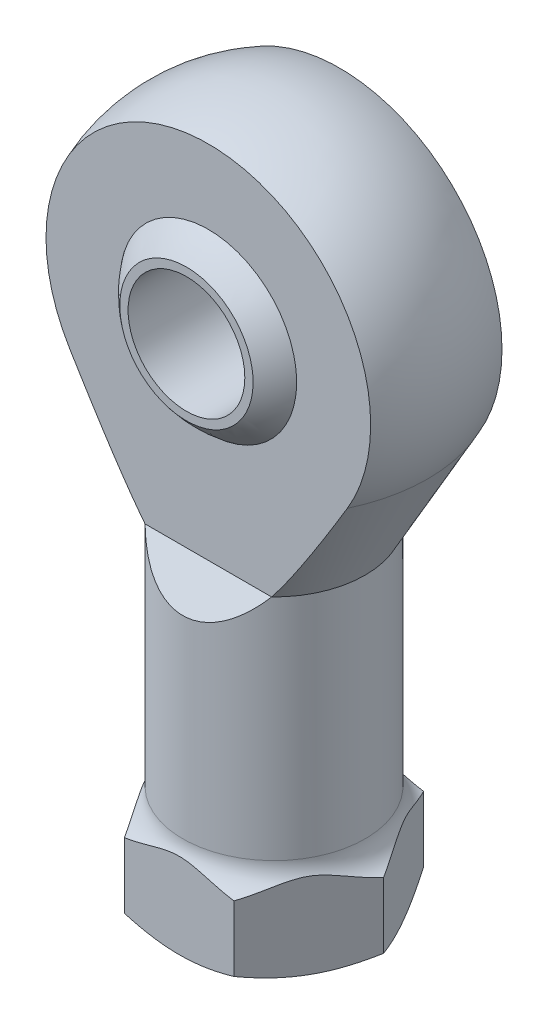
ISO-10303-21;
HEADER;
FILE_DESCRIPTION(('STEP AP214'),'2;1');
FILE_NAME('part.step','',(''),(''),'','','');
FILE_SCHEMA(('AUTOMOTIVE_DESIGN { 1 0 10303 214 1 1 1 1 }'));
ENDSEC;
DATA;
#1=APPLICATION_CONTEXT('core data for automotive mechanical design processes');
#2=APPLICATION_PROTOCOL_DEFINITION('international standard','automotive_design',2000,#1);
#3=PRODUCT_CONTEXT('',#1,'mechanical');
#4=PRODUCT('Part','Part','',(#3));
#5=PRODUCT_RELATED_PRODUCT_CATEGORY('part','',(#4));
#6=PRODUCT_DEFINITION_FORMATION('','',#4);
#7=PRODUCT_DEFINITION_CONTEXT('part definition',#1,'design');
#8=PRODUCT_DEFINITION('design','',#6,#7);
#9=PRODUCT_DEFINITION_SHAPE('','',#8);
#10=(LENGTH_UNIT() NAMED_UNIT(*) SI_UNIT(.MILLI.,.METRE.));
#11=(NAMED_UNIT(*) PLANE_ANGLE_UNIT() SI_UNIT($,.RADIAN.));
#12=(NAMED_UNIT(*) SI_UNIT($,.STERADIAN.) SOLID_ANGLE_UNIT());
#13=UNCERTAINTY_MEASURE_WITH_UNIT(LENGTH_MEASURE(1.E-05),#10,'distance_accuracy_value','');
#14=(GEOMETRIC_REPRESENTATION_CONTEXT(3) GLOBAL_UNCERTAINTY_ASSIGNED_CONTEXT((#13)) GLOBAL_UNIT_ASSIGNED_CONTEXT((#10,
#11,#12)) REPRESENTATION_CONTEXT('',''));
#15=CARTESIAN_POINT('',(0.,0.,0.));
#16=DIRECTION('',(0.,0.,1.));
#17=DIRECTION('',(1.,0.,0.));
#18=AXIS2_PLACEMENT_3D('',#15,#16,#17);
#19=CARTESIAN_POINT('',(0.,-7.47402337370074,0.));
#20=DIRECTION('',(0.,-1.,0.));
#21=DIRECTION('',(0.,0.,-1.));
#22=AXIS2_PLACEMENT_3D('',#19,#20,#21);
#23=CYLINDRICAL_SURFACE('',#22,1.);
#24=CARTESIAN_POINT('',(0.,-7.47402337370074,0.));
#25=DIRECTION('',(0.,-1.,0.));
#26=DIRECTION('',(0.,0.,-1.));
#27=AXIS2_PLACEMENT_3D('',#24,#25,#26);
#28=CIRCLE('',#27,1.);
#29=CARTESIAN_POINT('',(0.,-7.47402337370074,-1.));
#30=VERTEX_POINT('',#29);
#31=EDGE_CURVE('P0_E19',#30,#30,#28,.T.);
#32=ORIENTED_EDGE('',*,*,#31,.F.);
#33=EDGE_LOOP('',(#32));
#34=FACE_BOUND('',#33,.T.);
#35=CARTESIAN_POINT('',(0.,-14.8452994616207,0.));
#36=DIRECTION('',(0.,1.,0.));
#37=DIRECTION('',(0.,0.,1.));
#38=AXIS2_PLACEMENT_3D('',#35,#36,#37);
#39=CIRCLE('',#38,1.);
#40=CARTESIAN_POINT('',(0.,-14.8452994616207,-1.00000000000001));
#41=VERTEX_POINT('',#40);
#42=EDGE_CURVE('P0_E314',#41,#41,#39,.T.);
#43=ORIENTED_EDGE('',*,*,#42,.F.);
#44=EDGE_LOOP('',(#43));
#45=FACE_BOUND('',#44,.T.);
#46=ADVANCED_FACE('P0_F16',(#34,#45),#23,.F.);
#47=CARTESIAN_POINT('',(0.,-16.,0.));
#48=DIRECTION('',(0.,-1.,0.));
#49=DIRECTION('',(0.,0.,-1.));
#50=AXIS2_PLACEMENT_3D('',#47,#48,#49);
#51=CONICAL_SURFACE('',#50,3.,1.0471975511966);
#52=CARTESIAN_POINT('',(0.,-16.,0.));
#53=DIRECTION('',(0.,-1.,0.));
#54=DIRECTION('',(0.,0.,1.));
#55=AXIS2_PLACEMENT_3D('',#52,#53,#54);
#56=CIRCLE('',#55,3.);
#57=CARTESIAN_POINT('',(0.,-16.,-3.00000000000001));
#58=VERTEX_POINT('',#57);
#59=EDGE_CURVE('P0_E416',#58,#58,#56,.F.);
#60=CARTESIAN_POINT('',(0.,-16.,-3.00000000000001));
#61=CARTESIAN_POINT('',(0.,-15.9879718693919,-2.97916666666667));
#62=CARTESIAN_POINT('',(0.,-15.9759437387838,-2.95833333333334));
#63=CARTESIAN_POINT('',(0.,-15.9518874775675,-2.91666666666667));
#64=CARTESIAN_POINT('',(0.,-15.9398593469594,-2.89583333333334));
#65=CARTESIAN_POINT('',(0.,-15.9158030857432,-2.85416666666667));
#66=CARTESIAN_POINT('',(0.,-15.9037749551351,-2.83333333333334));
#67=CARTESIAN_POINT('',(0.,-15.8797186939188,-2.79166666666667));
#68=CARTESIAN_POINT('',(0.,-15.8676905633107,-2.77083333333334));
#69=CARTESIAN_POINT('',(0.,-15.8436343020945,-2.72916666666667));
#70=CARTESIAN_POINT('',(0.,-15.8316061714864,-2.70833333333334));
#71=CARTESIAN_POINT('',(0.,-15.8075499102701,-2.66666666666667));
#72=CARTESIAN_POINT('',(0.,-15.795521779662,-2.64583333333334));
#73=CARTESIAN_POINT('',(0.,-15.7714655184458,-2.60416666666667));
#74=CARTESIAN_POINT('',(0.,-15.7594373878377,-2.58333333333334));
#75=CARTESIAN_POINT('',(0.,-15.7353811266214,-2.54166666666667));
#76=CARTESIAN_POINT('',(0.,-15.7233529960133,-2.52083333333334));
#77=CARTESIAN_POINT('',(0.,-15.6992967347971,-2.47916666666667));
#78=CARTESIAN_POINT('',(0.,-15.687268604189,-2.45833333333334));
#79=CARTESIAN_POINT('',(0.,-15.6632123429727,-2.41666666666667));
#80=CARTESIAN_POINT('',(0.,-15.6511842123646,-2.39583333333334));
#81=CARTESIAN_POINT('',(0.,-15.6271279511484,-2.35416666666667));
#82=CARTESIAN_POINT('',(0.,-15.6150998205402,-2.33333333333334));
#83=CARTESIAN_POINT('',(0.,-15.591043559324,-2.29166666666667));
#84=CARTESIAN_POINT('',(0.,-15.5790154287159,-2.27083333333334));
#85=CARTESIAN_POINT('',(0.,-15.5549591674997,-2.22916666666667));
#86=CARTESIAN_POINT('',(0.,-15.5429310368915,-2.20833333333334));
#87=CARTESIAN_POINT('',(0.,-15.5188747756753,-2.16666666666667));
#88=CARTESIAN_POINT('',(0.,-15.5068466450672,-2.14583333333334));
#89=CARTESIAN_POINT('',(0.,-15.482790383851,-2.10416666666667));
#90=CARTESIAN_POINT('',(0.,-15.4707622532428,-2.08333333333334));
#91=CARTESIAN_POINT('',(0.,-15.4467059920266,-2.04166666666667));
#92=CARTESIAN_POINT('',(0.,-15.4346778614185,-2.02083333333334));
#93=CARTESIAN_POINT('',(0.,-15.4106216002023,-1.97916666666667));
#94=CARTESIAN_POINT('',(0.,-15.3985934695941,-1.95833333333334));
#95=CARTESIAN_POINT('',(0.,-15.3745372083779,-1.91666666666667));
#96=CARTESIAN_POINT('',(0.,-15.3625090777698,-1.89583333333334));
#97=CARTESIAN_POINT('',(0.,-15.3384528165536,-1.85416666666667));
#98=CARTESIAN_POINT('',(0.,-15.3264246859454,-1.83333333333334));
#99=CARTESIAN_POINT('',(0.,-15.3023684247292,-1.79166666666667));
#100=CARTESIAN_POINT('',(0.,-15.2903402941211,-1.77083333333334));
#101=CARTESIAN_POINT('',(0.,-15.2662840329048,-1.72916666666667));
#102=CARTESIAN_POINT('',(0.,-15.2542559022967,-1.70833333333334));
#103=CARTESIAN_POINT('',(0.,-15.2301996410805,-1.66666666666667));
#104=CARTESIAN_POINT('',(0.,-15.2181715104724,-1.64583333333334));
#105=CARTESIAN_POINT('',(0.,-15.1941152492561,-1.60416666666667));
#106=CARTESIAN_POINT('',(0.,-15.182087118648,-1.58333333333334));
#107=CARTESIAN_POINT('',(0.,-15.1580308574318,-1.54166666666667));
#108=CARTESIAN_POINT('',(0.,-15.1460027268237,-1.52083333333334));
#109=CARTESIAN_POINT('',(0.,-15.1219464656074,-1.47916666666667));
#110=CARTESIAN_POINT('',(0.,-15.1099183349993,-1.45833333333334));
#111=CARTESIAN_POINT('',(0.,-15.0858620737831,-1.41666666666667));
#112=CARTESIAN_POINT('',(0.,-15.073833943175,-1.39583333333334));
#113=CARTESIAN_POINT('',(0.,-15.0497776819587,-1.35416666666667));
#114=CARTESIAN_POINT('',(0.,-15.0377495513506,-1.33333333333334));
#115=CARTESIAN_POINT('',(0.,-15.0136932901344,-1.29166666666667));
#116=CARTESIAN_POINT('',(0.,-15.0016651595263,-1.27083333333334));
#117=CARTESIAN_POINT('',(0.,-14.97760889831,-1.22916666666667));
#118=CARTESIAN_POINT('',(0.,-14.9655807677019,-1.20833333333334));
#119=CARTESIAN_POINT('',(0.,-14.9415245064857,-1.16666666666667));
#120=CARTESIAN_POINT('',(0.,-14.9294963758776,-1.14583333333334));
#121=CARTESIAN_POINT('',(0.,-14.9054401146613,-1.10416666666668));
#122=CARTESIAN_POINT('',(0.,-14.8934119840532,-1.08333333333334));
#123=CARTESIAN_POINT('',(0.,-14.869355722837,-1.04166666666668));
#124=CARTESIAN_POINT('',(0.,-14.8573275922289,-1.02083333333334));
#125=CARTESIAN_POINT('',(0.,-14.8452994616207,-1.00000000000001));
#126=B_SPLINE_CURVE_WITH_KNOTS('',3,(#60,#61,#62,#63,#64,#65,#66,#67,#68,#69,#70,#71,#72,#73,
#74,#75,#76,#77,#78,#79,#80,#81,#82,#83,#84,#85,#86,#87,#88,#89,#90,#91,#92,#93,#94,#95,#96,#97,
#98,#99,#100,#101,#102,#103,#104,#105,#106,#107,#108,#109,#110,#111,#112,#113,#114,#115,#116,
#117,#118,#119,#120,#121,#122,#123,#124,#125),.UNSPECIFIED.,.F.,.F.,(4,2,2,2,2,2,2,2,2,2,2,2,2,
2,2,2,2,2,2,2,2,2,2,2,2,2,2,2,2,2,2,2,4),(0.,0.0721687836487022,0.144337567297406,
0.216506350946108,0.288675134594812,0.360843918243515,0.433012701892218,0.505181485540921,
0.577350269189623,0.649519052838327,0.721687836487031,0.793856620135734,0.866025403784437,
0.93819418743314,1.01036297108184,1.08253175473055,1.15470053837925,1.22686932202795,
1.29903810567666,1.37120688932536,1.44337567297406,1.51554445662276,1.58771324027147,
1.65988202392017,1.73205080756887,1.80421959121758,1.87638837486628,1.94855715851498,
2.02072594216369,2.09289472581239,2.16506350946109,2.2372322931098,2.3094010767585),.UNSPECIFIED.);
#127=EDGE_CURVE('P0_BSEAM425',#58,#41,#126,.T.);
#128=ORIENTED_EDGE('',*,*,#59,.F.);
#129=ORIENTED_EDGE('',*,*,#42,.T.);
#130=ORIENTED_EDGE('',*,*,#127,.T.);
#131=ORIENTED_EDGE('',*,*,#127,.F.);
#132=EDGE_LOOP('',(#128,#130,#129,#131));
#133=FACE_BOUND('',#132,.T.);
#134=ADVANCED_FACE('P0_F425',(#133),#51,.F.);
#135=CARTESIAN_POINT('',(0.,0.,0.));
#136=DIRECTION('',(0.,0.,1.));
#137=DIRECTION('',(-1.,0.,0.));
#138=AXIS2_PLACEMENT_3D('',#135,#136,#137);
#139=SPHERICAL_SURFACE('',#138,7.540625);
#140=CARTESIAN_POINT('',(0.,0.,-4.5));
#141=DIRECTION('',(0.,0.,1.));
#142=DIRECTION('',(1.,0.,0.));
#143=AXIS2_PLACEMENT_3D('',#140,#141,#142);
#144=CIRCLE('',#143,6.05070453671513);
#145=CARTESIAN_POINT('',(6.05070453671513,0.,-4.5));
#146=VERTEX_POINT('',#145);
#147=EDGE_CURVE('P0_E136',#146,#146,#144,.T.);
#148=ORIENTED_EDGE('',*,*,#147,.F.);
#149=EDGE_LOOP('',(#148));
#150=FACE_BOUND('',#149,.T.);
#151=CARTESIAN_POINT('',(0.,0.,4.5));
#152=DIRECTION('',(0.,0.,1.));
#153=DIRECTION('',(1.,0.,0.));
#154=AXIS2_PLACEMENT_3D('',#151,#152,#153);
#155=CIRCLE('',#154,6.05070453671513);
#156=CARTESIAN_POINT('',(6.05070453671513,0.,4.5));
#157=VERTEX_POINT('',#156);
#158=EDGE_CURVE('P0_E119',#157,#157,#155,.F.);
#159=ORIENTED_EDGE('',*,*,#158,.F.);
#160=EDGE_LOOP('',(#159));
#161=FACE_BOUND('',#160,.T.);
#162=ORIENTED_EDGE('',*,*,#31,.T.);
#163=EDGE_LOOP('',(#162));
#164=FACE_BOUND('',#163,.T.);
#165=ADVANCED_FACE('P0_F413',(#150,#161,#164),#139,.F.);
#166=CARTESIAN_POINT('',(0.,-16.,0.));
#167=DIRECTION('',(0.,-1.,0.));
#168=DIRECTION('',(0.,0.,-1.));
#169=AXIS2_PLACEMENT_3D('',#166,#167,#168);
#170=CYLINDRICAL_SURFACE('',#169,3.);
#171=CARTESIAN_POINT('',(0.,-36.,0.));
#172=DIRECTION('',(0.,-1.,0.));
#173=DIRECTION('',(0.,0.,-1.));
#174=AXIS2_PLACEMENT_3D('',#171,#172,#173);
#175=CIRCLE('',#174,3.);
#176=CARTESIAN_POINT('',(0.,-36.,-3.));
#177=VERTEX_POINT('',#176);
#178=EDGE_CURVE('P0_E129',#177,#177,#175,.F.);
#179=ORIENTED_EDGE('',*,*,#178,.F.);
#180=EDGE_LOOP('',(#179));
#181=FACE_BOUND('',#180,.T.);
#182=ORIENTED_EDGE('',*,*,#59,.T.);
#183=EDGE_LOOP('',(#182));
#184=FACE_BOUND('',#183,.T.);
#185=ADVANCED_FACE('P0_F184',(#181,#184),#170,.F.);
#186=CARTESIAN_POINT('',(11.1242977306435,-13.6,4.5));
#187=CARTESIAN_POINT('',(11.1242977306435,11.1242977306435,4.5));
#188=CARTESIAN_POINT('',(11.1242977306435,11.3715407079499,4.5));
#189=B_SPLINE_CURVE_WITH_KNOTS('',1,(#186,#187,#188),.UNSPECIFIED.,.F.,.F.,(2,1,2),(0.,1.,1.01),.UNSPECIFIED.);
#190=DIRECTION('',(-1.,0.,0.));
#191=VECTOR('',#190,1.);
#192=SURFACE_OF_LINEAR_EXTRUSION('',#189,#191);
#193=ORIENTED_EDGE('',*,*,#158,.T.);
#194=EDGE_LOOP('',(#193));
#195=FACE_BOUND('',#194,.T.);
#196=CARTESIAN_POINT('',(9.52473389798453,-5.74712486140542,4.5));
#197=CARTESIAN_POINT('',(9.36248462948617,-6.01600442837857,4.5));
#198=CARTESIAN_POINT('',(9.19969447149,-6.28455906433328,4.5));
#199=CARTESIAN_POINT('',(8.87288136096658,-6.82079182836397,4.5));
#200=CARTESIAN_POINT('',(8.70885884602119,-7.08847022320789,4.5));
#201=CARTESIAN_POINT('',(8.37937243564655,-7.62282176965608,4.5));
#202=CARTESIAN_POINT('',(8.21390901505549,-7.88949521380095,4.5));
#203=CARTESIAN_POINT('',(7.88126733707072,-8.42166710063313,4.5));
#204=CARTESIAN_POINT('',(7.71408957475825,-8.68716585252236,4.5));
#205=CARTESIAN_POINT('',(7.37767567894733,-9.21677549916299,4.5));
#206=CARTESIAN_POINT('',(7.20844000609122,-9.4808866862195,4.5));
#207=CARTESIAN_POINT('',(6.86737855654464,-10.0075816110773,4.5));
#208=CARTESIAN_POINT('',(6.69555178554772,-10.2701647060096,4.5));
#209=CARTESIAN_POINT('',(6.34881554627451,-10.7932888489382,4.5));
#210=CARTESIAN_POINT('',(6.17390609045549,-11.0538299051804,4.5));
#211=CARTESIAN_POINT('',(5.82024326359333,-11.5723457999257,4.5));
#212=CARTESIAN_POINT('',(5.64148943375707,-11.8303203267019,4.5));
#213=CARTESIAN_POINT('',(5.3696932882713,-12.2147699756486,4.5));
#214=CARTESIAN_POINT('',(5.2784641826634,-12.3425276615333,4.5));
#215=CARTESIAN_POINT('',(5.09462881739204,-12.5970462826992,4.5));
#216=CARTESIAN_POINT('',(5.00202258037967,-12.7238072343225,4.5));
#217=CARTESIAN_POINT('',(4.81515166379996,-12.9762947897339,4.5));
#218=CARTESIAN_POINT('',(4.72088545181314,-13.1020202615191,4.5));
#219=CARTESIAN_POINT('',(4.53053479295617,-13.3520975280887,4.5));
#220=CARTESIAN_POINT('',(4.43445024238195,-13.4764492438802,4.5));
#221=CARTESIAN_POINT('',(4.33733789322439,-13.6,4.50000000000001));
#222=B_SPLINE_CURVE_WITH_KNOTS('',3,(#196,#197,#198,#199,#200,#201,#202,#203,#204,#205,#206,
#207,#208,#209,#210,#211,#212,#213,#214,#215,#216,#217,#218,#219,#220,#221),.UNSPECIFIED.,.F.,
.F.,(4,2,2,2,2,2,2,2,2,2,2,2,4),(0.,0.942120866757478,1.8839216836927,2.82542307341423,
3.76665982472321,4.70768963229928,5.64909023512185,6.590487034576,7.53199681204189,
8.0029490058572,8.47389346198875,8.94529819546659,9.41672989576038),.UNSPECIFIED.);
#223=CARTESIAN_POINT('',(9.52473389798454,-5.74712486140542,4.5));
#224=VERTEX_POINT('',#223);
#225=CARTESIAN_POINT('',(4.33733789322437,-13.6,4.5));
#226=VERTEX_POINT('',#225);
#227=EDGE_CURVE('P0_E123',#224,#226,#222,.T.);
#228=ORIENTED_EDGE('',*,*,#227,.F.);
#229=CARTESIAN_POINT('',(0.,0.,4.5));
#230=DIRECTION('',(0.,0.,1.));
#231=DIRECTION('',(1.,0.,0.));
#232=AXIS2_PLACEMENT_3D('',#229,#230,#231);
#233=CIRCLE('',#232,11.1242977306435);
#234=CARTESIAN_POINT('',(-9.52473389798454,-5.74712486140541,4.5));
#235=VERTEX_POINT('',#234);
#236=EDGE_CURVE('P0_E109',#235,#224,#233,.F.);
#237=ORIENTED_EDGE('',*,*,#236,.F.);
#238=CARTESIAN_POINT('',(-4.33733789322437,-13.6,4.5));
#239=CARTESIAN_POINT('',(-4.43445024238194,-13.4764492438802,4.5));
#240=CARTESIAN_POINT('',(-4.53053479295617,-13.3520975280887,4.5));
#241=CARTESIAN_POINT('',(-4.72088545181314,-13.1020202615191,4.5));
#242=CARTESIAN_POINT('',(-4.81515166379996,-12.9762947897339,4.5));
#243=CARTESIAN_POINT('',(-5.00202258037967,-12.7238072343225,4.5));
#244=CARTESIAN_POINT('',(-5.09462881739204,-12.5970462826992,4.5));
#245=CARTESIAN_POINT('',(-5.27846418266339,-12.3425276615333,4.5));
#246=CARTESIAN_POINT('',(-5.3696932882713,-12.2147699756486,4.5));
#247=CARTESIAN_POINT('',(-5.64148943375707,-11.8303203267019,4.5));
#248=CARTESIAN_POINT('',(-5.82024326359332,-11.5723457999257,4.5));
#249=CARTESIAN_POINT('',(-6.17390609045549,-11.0538299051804,4.5));
#250=CARTESIAN_POINT('',(-6.34881554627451,-10.7932888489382,4.5));
#251=CARTESIAN_POINT('',(-6.69555178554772,-10.2701647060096,4.5));
#252=CARTESIAN_POINT('',(-6.86737855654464,-10.0075816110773,4.5));
#253=CARTESIAN_POINT('',(-7.20844000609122,-9.4808866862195,4.5));
#254=CARTESIAN_POINT('',(-7.37767567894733,-9.21677549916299,4.5));
#255=CARTESIAN_POINT('',(-7.71408957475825,-8.68716585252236,4.5));
#256=CARTESIAN_POINT('',(-7.88126733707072,-8.42166710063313,4.5));
#257=CARTESIAN_POINT('',(-8.21390901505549,-7.88949521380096,4.5));
#258=CARTESIAN_POINT('',(-8.37937243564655,-7.62282176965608,4.5));
#259=CARTESIAN_POINT('',(-8.70885884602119,-7.08847022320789,4.5));
#260=CARTESIAN_POINT('',(-8.87288136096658,-6.82079182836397,4.5));
#261=CARTESIAN_POINT('',(-9.19969447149,-6.28455906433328,4.5));
#262=CARTESIAN_POINT('',(-9.36248462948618,-6.01600442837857,4.5));
#263=CARTESIAN_POINT('',(-9.52473389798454,-5.74712486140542,4.5));
#264=B_SPLINE_CURVE_WITH_KNOTS('',3,(#238,#239,#240,#241,#242,#243,#244,#245,#246,#247,#248,
#249,#250,#251,#252,#253,#254,#255,#256,#257,#258,#259,#260,#261,#262,#263),.UNSPECIFIED.,.F.,
.F.,(4,2,2,2,2,2,2,2,2,2,2,2,4),(0.,0.471431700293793,0.942836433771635,1.41378088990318,
1.8847330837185,2.82624286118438,3.76763966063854,4.7090402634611,5.65007007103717,
6.59130682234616,7.53280821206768,8.47460902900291,9.41672989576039),.UNSPECIFIED.);
#265=CARTESIAN_POINT('',(-4.33733789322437,-13.6,4.5));
#266=VERTEX_POINT('',#265);
#267=EDGE_CURVE('P0_E189',#266,#235,#264,.T.);
#268=ORIENTED_EDGE('',*,*,#267,.F.);
#269=DIRECTION('',(-1.,0.,0.));
#270=VECTOR('',#269,1.);
#271=CARTESIAN_POINT('',(4.33733789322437,-13.6,4.5));
#272=LINE('',#271,#270);
#273=EDGE_CURVE('P0_E126',#226,#266,#272,.T.);
#274=ORIENTED_EDGE('',*,*,#273,.F.);
#275=EDGE_LOOP('',(#228,#237,#268,#274));
#276=FACE_BOUND('',#275,.T.);
#277=ADVANCED_FACE('P0_F124',(#195,#276),#192,.T.);
#278=CARTESIAN_POINT('',(0.,0.,0.));
#279=DIRECTION('',(0.,0.,1.));
#280=DIRECTION('',(1.,0.,0.));
#281=AXIS2_PLACEMENT_3D('',#278,#279,#280);
#282=SPHERICAL_SURFACE('',#281,12.);
#283=CARTESIAN_POINT('',(0.,-5.74712486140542,0.));
#284=DIRECTION('',(0.,1.,0.));
#285=DIRECTION('',(0.,0.,1.));
#286=AXIS2_PLACEMENT_3D('',#283,#284,#285);
#287=CIRCLE('',#286,10.5342563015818);
#288=CARTESIAN_POINT('',(-9.52473389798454,-5.74712486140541,-4.5));
#289=VERTEX_POINT('',#288);
#290=EDGE_CURVE('P0_E107',#235,#289,#287,.F.);
#291=ORIENTED_EDGE('',*,*,#290,.F.);
#292=ORIENTED_EDGE('',*,*,#236,.T.);
#293=CARTESIAN_POINT('',(0.,-5.74712486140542,0.));
#294=DIRECTION('',(0.,1.,0.));
#295=DIRECTION('',(0.,0.,1.));
#296=AXIS2_PLACEMENT_3D('',#293,#294,#295);
#297=CIRCLE('',#296,10.5342563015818);
#298=CARTESIAN_POINT('',(9.52473389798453,-5.74712486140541,-4.5));
#299=VERTEX_POINT('',#298);
#300=EDGE_CURVE('P0_E113',#299,#224,#297,.F.);
#301=ORIENTED_EDGE('',*,*,#300,.F.);
#302=CARTESIAN_POINT('',(0.,0.,-4.5));
#303=DIRECTION('',(0.,0.,1.));
#304=DIRECTION('',(1.,0.,0.));
#305=AXIS2_PLACEMENT_3D('',#302,#303,#304);
#306=CIRCLE('',#305,11.1242977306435);
#307=EDGE_CURVE('P0_E118',#289,#299,#306,.F.);
#308=ORIENTED_EDGE('',*,*,#307,.F.);
#309=EDGE_LOOP('',(#291,#292,#301,#308));
#310=FACE_BOUND('',#309,.T.);
#311=ADVANCED_FACE('P0_F111',(#310),#282,.T.);
#312=CARTESIAN_POINT('',(11.1242977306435,11.3715407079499,-4.5));
#313=CARTESIAN_POINT('',(11.1242977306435,11.1242977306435,-4.5));
#314=CARTESIAN_POINT('',(11.1242977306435,-13.6,-4.5));
#315=B_SPLINE_CURVE_WITH_KNOTS('',1,(#312,#313,#314),.UNSPECIFIED.,.F.,.F.,(2,1,2),(-0.01,0.,
1.),.UNSPECIFIED.);
#316=DIRECTION('',(-1.,0.,0.));
#317=VECTOR('',#316,1.);
#318=SURFACE_OF_LINEAR_EXTRUSION('',#315,#317);
#319=ORIENTED_EDGE('',*,*,#147,.T.);
#320=EDGE_LOOP('',(#319));
#321=FACE_BOUND('',#320,.T.);
#322=CARTESIAN_POINT('',(-9.52473389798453,-5.74712486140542,-4.5));
#323=CARTESIAN_POINT('',(-9.36248462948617,-6.01600442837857,-4.5));
#324=CARTESIAN_POINT('',(-9.19969447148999,-6.28455906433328,-4.5));
#325=CARTESIAN_POINT('',(-8.87288136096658,-6.82079182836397,-4.5));
#326=CARTESIAN_POINT('',(-8.70885884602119,-7.08847022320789,-4.5));
#327=CARTESIAN_POINT('',(-8.37937243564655,-7.62282176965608,-4.5));
#328=CARTESIAN_POINT('',(-8.21390901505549,-7.88949521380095,-4.5));
#329=CARTESIAN_POINT('',(-7.88126733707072,-8.42166710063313,-4.5));
#330=CARTESIAN_POINT('',(-7.71408957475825,-8.68716585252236,-4.5));
#331=CARTESIAN_POINT('',(-7.37767567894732,-9.21677549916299,-4.5));
#332=CARTESIAN_POINT('',(-7.20844000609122,-9.4808866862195,-4.5));
#333=CARTESIAN_POINT('',(-6.86737855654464,-10.0075816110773,-4.5));
#334=CARTESIAN_POINT('',(-6.69555178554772,-10.2701647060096,-4.5));
#335=CARTESIAN_POINT('',(-6.34881554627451,-10.7932888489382,-4.5));
#336=CARTESIAN_POINT('',(-6.17390609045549,-11.0538299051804,-4.5));
#337=CARTESIAN_POINT('',(-5.82024326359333,-11.5723457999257,-4.5));
#338=CARTESIAN_POINT('',(-5.64148943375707,-11.8303203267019,-4.5));
#339=CARTESIAN_POINT('',(-5.3696932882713,-12.2147699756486,-4.5));
#340=CARTESIAN_POINT('',(-5.2784641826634,-12.3425276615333,-4.5));
#341=CARTESIAN_POINT('',(-5.09462881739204,-12.5970462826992,-4.5));
#342=CARTESIAN_POINT('',(-5.00202258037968,-12.7238072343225,-4.5));
#343=CARTESIAN_POINT('',(-4.81515166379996,-12.9762947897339,-4.5));
#344=CARTESIAN_POINT('',(-4.72088545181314,-13.1020202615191,-4.5));
#345=CARTESIAN_POINT('',(-4.53053479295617,-13.3520975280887,-4.5));
#346=CARTESIAN_POINT('',(-4.43445024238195,-13.4764492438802,-4.5));
#347=CARTESIAN_POINT('',(-4.33733789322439,-13.6,-4.50000000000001));
#348=B_SPLINE_CURVE_WITH_KNOTS('',3,(#322,#323,#324,#325,#326,#327,#328,#329,#330,#331,#332,
#333,#334,#335,#336,#337,#338,#339,#340,#341,#342,#343,#344,#345,#346,#347),.UNSPECIFIED.,.F.,
.F.,(4,2,2,2,2,2,2,2,2,2,2,2,4),(0.,0.942120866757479,1.8839216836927,2.82542307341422,
3.76665982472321,4.70768963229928,5.64909023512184,6.590487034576,7.53199681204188,
8.0029490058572,8.47389346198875,8.94529819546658,9.41672989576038),.UNSPECIFIED.);
#349=CARTESIAN_POINT('',(-4.33733789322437,-13.6,-4.5));
#350=VERTEX_POINT('',#349);
#351=EDGE_CURVE('P0_E208',#289,#350,#348,.T.);
#352=ORIENTED_EDGE('',*,*,#351,.F.);
#353=ORIENTED_EDGE('',*,*,#307,.T.);
#354=CARTESIAN_POINT('',(4.33733789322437,-13.6,-4.5));
#355=CARTESIAN_POINT('',(4.43445024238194,-13.4764492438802,-4.5));
#356=CARTESIAN_POINT('',(4.53053479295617,-13.3520975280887,-4.5));
#357=CARTESIAN_POINT('',(4.72088545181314,-13.1020202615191,-4.5));
#358=CARTESIAN_POINT('',(4.81515166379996,-12.9762947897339,-4.5));
#359=CARTESIAN_POINT('',(5.00202258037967,-12.7238072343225,-4.5));
#360=CARTESIAN_POINT('',(5.09462881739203,-12.5970462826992,-4.5));
#361=CARTESIAN_POINT('',(5.27846418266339,-12.3425276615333,-4.5));
#362=CARTESIAN_POINT('',(5.36969328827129,-12.2147699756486,-4.5));
#363=CARTESIAN_POINT('',(5.64148943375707,-11.8303203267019,-4.5));
#364=CARTESIAN_POINT('',(5.82024326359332,-11.5723457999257,-4.5));
#365=CARTESIAN_POINT('',(6.17390609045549,-11.0538299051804,-4.5));
#366=CARTESIAN_POINT('',(6.34881554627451,-10.7932888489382,-4.5));
#367=CARTESIAN_POINT('',(6.69555178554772,-10.2701647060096,-4.5));
#368=CARTESIAN_POINT('',(6.86737855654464,-10.0075816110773,-4.5));
#369=CARTESIAN_POINT('',(7.20844000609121,-9.4808866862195,-4.5));
#370=CARTESIAN_POINT('',(7.37767567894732,-9.21677549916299,-4.5));
#371=CARTESIAN_POINT('',(7.71408957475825,-8.68716585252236,-4.5));
#372=CARTESIAN_POINT('',(7.88126733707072,-8.42166710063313,-4.5));
#373=CARTESIAN_POINT('',(8.21390901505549,-7.88949521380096,-4.5));
#374=CARTESIAN_POINT('',(8.37937243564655,-7.62282176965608,-4.5));
#375=CARTESIAN_POINT('',(8.70885884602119,-7.0884702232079,-4.5));
#376=CARTESIAN_POINT('',(8.87288136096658,-6.82079182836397,-4.5));
#377=CARTESIAN_POINT('',(9.19969447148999,-6.28455906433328,-4.5));
#378=CARTESIAN_POINT('',(9.36248462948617,-6.01600442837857,-4.5));
#379=CARTESIAN_POINT('',(9.52473389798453,-5.74712486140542,-4.5));
#380=B_SPLINE_CURVE_WITH_KNOTS('',3,(#354,#355,#356,#357,#358,#359,#360,#361,#362,#363,#364,
#365,#366,#367,#368,#369,#370,#371,#372,#373,#374,#375,#376,#377,#378,#379),.UNSPECIFIED.,.F.,
.F.,(4,2,2,2,2,2,2,2,2,2,2,2,4),(0.,0.471431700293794,0.942836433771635,1.41378088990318,
1.8847330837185,2.82624286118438,3.76763966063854,4.7090402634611,5.65007007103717,
6.59130682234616,7.53280821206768,8.47460902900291,9.41672989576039),.UNSPECIFIED.);
#381=CARTESIAN_POINT('',(4.33733789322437,-13.6,-4.5));
#382=VERTEX_POINT('',#381);
#383=EDGE_CURVE('P0_E134',#382,#299,#380,.T.);
#384=ORIENTED_EDGE('',*,*,#383,.F.);
#385=DIRECTION('',(-1.,0.,0.));
#386=VECTOR('',#385,1.);
#387=CARTESIAN_POINT('',(4.33733789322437,-13.6,-4.5));
#388=LINE('',#387,#386);
#389=EDGE_CURVE('P0_E214',#350,#382,#388,.F.);
#390=ORIENTED_EDGE('',*,*,#389,.F.);
#391=EDGE_LOOP('',(#352,#353,#384,#390));
#392=FACE_BOUND('',#391,.T.);
#393=ADVANCED_FACE('P0_F152',(#321,#392),#318,.T.);
#394=CARTESIAN_POINT('',(0.,-13.6,0.));
#395=DIRECTION('',(0.,1.,0.));
#396=DIRECTION('',(0.,0.,1.));
#397=AXIS2_PLACEMENT_3D('',#394,#395,#396);
#398=CONICAL_SURFACE('',#397,6.25,0.499432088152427);
#399=ORIENTED_EDGE('',*,*,#227,.T.);
#400=CARTESIAN_POINT('',(0.,-13.6,0.));
#401=DIRECTION('',(0.,-1.,0.));
#402=DIRECTION('',(0.,0.,1.));
#403=AXIS2_PLACEMENT_3D('',#400,#401,#402);
#404=CIRCLE('',#403,6.25);
#405=EDGE_CURVE('P0_E222',#382,#226,#404,.T.);
#406=ORIENTED_EDGE('',*,*,#405,.F.);
#407=ORIENTED_EDGE('',*,*,#383,.T.);
#408=ORIENTED_EDGE('',*,*,#300,.T.);
#409=EDGE_LOOP('',(#399,#406,#407,#408));
#410=FACE_BOUND('',#409,.T.);
#411=ADVANCED_FACE('P0_F132',(#410),#398,.T.);
#412=CARTESIAN_POINT('',(6.57800330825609,-36.,-6.5));
#413=DIRECTION('',(0.,-1.,0.));
#414=DIRECTION('',(0.,0.,1.));
#415=AXIS2_PLACEMENT_3D('',#412,#413,#414);
#416=PLANE('',#415);
#417=ORIENTED_EDGE('',*,*,#178,.T.);
#418=EDGE_LOOP('',(#417));
#419=FACE_BOUND('',#418,.T.);
#420=CARTESIAN_POINT('',(0.,-36.,0.));
#421=DIRECTION('',(0.,1.,0.));
#422=DIRECTION('',(0.,0.,1.));
#423=AXIS2_PLACEMENT_3D('',#420,#421,#422);
#424=CIRCLE('',#423,6.5);
#425=CARTESIAN_POINT('',(5.62916512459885,-36.,3.25));
#426=VERTEX_POINT('',#425);
#427=CARTESIAN_POINT('',(5.62916512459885,-36.,-3.25));
#428=VERTEX_POINT('',#427);
#429=EDGE_CURVE('P0_E196',#426,#428,#424,.T.);
#430=ORIENTED_EDGE('',*,*,#429,.F.);
#431=CARTESIAN_POINT('',(0.,-36.,0.));
#432=DIRECTION('',(0.,1.,0.));
#433=DIRECTION('',(0.,0.,1.));
#434=AXIS2_PLACEMENT_3D('',#431,#432,#433);
#435=CIRCLE('',#434,6.50000000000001);
#436=CARTESIAN_POINT('',(0.,-36.,6.5));
#437=VERTEX_POINT('',#436);
#438=EDGE_CURVE('P0_E474',#437,#426,#435,.T.);
#439=ORIENTED_EDGE('',*,*,#438,.F.);
#440=CARTESIAN_POINT('',(0.,-36.,0.));
#441=DIRECTION('',(0.,1.,0.));
#442=DIRECTION('',(0.,0.,1.));
#443=AXIS2_PLACEMENT_3D('',#440,#441,#442);
#444=CIRCLE('',#443,6.5);
#445=CARTESIAN_POINT('',(-5.62916512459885,-36.,3.25));
#446=VERTEX_POINT('',#445);
#447=EDGE_CURVE('P0_E467',#446,#437,#444,.T.);
#448=ORIENTED_EDGE('',*,*,#447,.F.);
#449=CARTESIAN_POINT('',(0.,-36.,0.));
#450=DIRECTION('',(0.,1.,0.));
#451=DIRECTION('',(0.,0.,1.));
#452=AXIS2_PLACEMENT_3D('',#449,#450,#451);
#453=CIRCLE('',#452,6.5);
#454=CARTESIAN_POINT('',(-5.62916512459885,-36.,-3.25));
#455=VERTEX_POINT('',#454);
#456=EDGE_CURVE('P0_E465',#455,#446,#453,.T.);
#457=ORIENTED_EDGE('',*,*,#456,.F.);
#458=CARTESIAN_POINT('',(0.,-36.,0.));
#459=DIRECTION('',(0.,1.,0.));
#460=DIRECTION('',(0.,0.,1.));
#461=AXIS2_PLACEMENT_3D('',#458,#459,#460);
#462=CIRCLE('',#461,6.50000000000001);
#463=CARTESIAN_POINT('',(0.,-36.,-6.5));
#464=VERTEX_POINT('',#463);
#465=EDGE_CURVE('P0_E468',#464,#455,#462,.T.);
#466=ORIENTED_EDGE('',*,*,#465,.F.);
#467=CARTESIAN_POINT('',(0.,-36.,0.));
#468=DIRECTION('',(0.,1.,0.));
#469=DIRECTION('',(0.,0.,1.));
#470=AXIS2_PLACEMENT_3D('',#467,#468,#469);
#471=CIRCLE('',#470,6.5);
#472=EDGE_CURVE('P0_E486',#428,#464,#471,.T.);
#473=ORIENTED_EDGE('',*,*,#472,.F.);
#474=EDGE_LOOP('',(#430,#439,#448,#457,#466,#473));
#475=FACE_BOUND('',#474,.T.);
#476=ADVANCED_FACE('P0_F233',(#419,#475),#416,.T.);
#477=CARTESIAN_POINT('',(0.,-36.,0.));
#478=DIRECTION('',(0.,1.,0.));
#479=DIRECTION('',(0.,0.,1.));
#480=AXIS2_PLACEMENT_3D('',#477,#478,#479);
#481=CONICAL_SURFACE('',#480,6.5,1.04719755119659);
#482=ORIENTED_EDGE('',*,*,#429,.T.);
#483=CARTESIAN_POINT('',(7.50555349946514,-35.4194434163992,0.));
#484=CARTESIAN_POINT('',(7.35281628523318,-35.5076484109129,-0.264548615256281));
#485=CARTESIAN_POINT('',(7.19885589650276,-35.5884595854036,-0.531215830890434));
#486=CARTESIAN_POINT('',(6.88957797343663,-35.7309686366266,-1.06690090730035));
#487=CARTESIAN_POINT('',(6.73427122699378,-35.7927610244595,-1.33590008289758));
#488=CARTESIAN_POINT('',(6.49984538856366,-35.8686315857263,-1.74193754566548));
#489=CARTESIAN_POINT('',(6.42140731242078,-35.8911279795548,-1.8777962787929));
#490=CARTESIAN_POINT('',(6.26415564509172,-35.9300697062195,-2.15016415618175));
#491=CARTESIAN_POINT('',(6.18534206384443,-35.9465151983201,-2.28667328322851));
#492=CARTESIAN_POINT('',(6.02704786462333,-35.9730661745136,-2.5608468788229));
#493=CARTESIAN_POINT('',(5.94756588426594,-35.983139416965,-2.69851370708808));
#494=CARTESIAN_POINT('',(5.78844560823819,-35.9966202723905,-2.97411810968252));
#495=CARTESIAN_POINT('',(5.70880728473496,-36.0000265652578,-3.11205573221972));
#496=CARTESIAN_POINT('',(5.62916512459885,-36.,-3.25));
#497=B_SPLINE_CURVE_WITH_KNOTS('',3,(#483,#484,#485,#486,#487,#488,#489,#490,#491,#492,#493,
#494,#495,#496),.UNSPECIFIED.,.F.,.F.,(4,2,2,2,2,2,4),(0.,0.95424765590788,1.90367376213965,
2.37900973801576,2.85433320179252,3.33204281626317,3.80984701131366),.UNSPECIFIED.);
#498=CARTESIAN_POINT('',(7.50555349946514,-35.4194434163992,0.));
#499=VERTEX_POINT('',#498);
#500=EDGE_CURVE('P0_E215',#499,#428,#497,.T.);
#501=ORIENTED_EDGE('',*,*,#500,.F.);
#502=CARTESIAN_POINT('',(5.62916512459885,-36.,3.25));
#503=CARTESIAN_POINT('',(5.70880728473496,-36.0000265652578,3.11205573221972));
#504=CARTESIAN_POINT('',(5.78844560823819,-35.9966202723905,2.97411810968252));
#505=CARTESIAN_POINT('',(5.94756588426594,-35.983139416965,2.69851370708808));
#506=CARTESIAN_POINT('',(6.02704786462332,-35.9730661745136,2.5608468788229));
#507=CARTESIAN_POINT('',(6.18534206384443,-35.9465151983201,2.28667328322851));
#508=CARTESIAN_POINT('',(6.26415564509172,-35.9300697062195,2.15016415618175));
#509=CARTESIAN_POINT('',(6.42140731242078,-35.8911279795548,1.8777962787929));
#510=CARTESIAN_POINT('',(6.49984538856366,-35.8686315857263,1.74193754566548));
#511=CARTESIAN_POINT('',(6.73427122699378,-35.7927610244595,1.33590008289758));
#512=CARTESIAN_POINT('',(6.88957797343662,-35.7309686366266,1.06690090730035));
#513=CARTESIAN_POINT('',(7.19885589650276,-35.5884595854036,0.531215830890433));
#514=CARTESIAN_POINT('',(7.35281628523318,-35.5076484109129,0.26454861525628));
#515=CARTESIAN_POINT('',(7.50555349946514,-35.4194434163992,0.));
#516=B_SPLINE_CURVE_WITH_KNOTS('',3,(#502,#503,#504,#505,#506,#507,#508,#509,#510,#511,#512,
#513,#514,#515),.UNSPECIFIED.,.F.,.F.,(4,2,2,2,2,2,4),(0.,0.477804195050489,0.955513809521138,
1.43083727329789,1.906173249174,2.85559935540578,3.80984701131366),.UNSPECIFIED.);
#517=EDGE_CURVE('P0_E237',#426,#499,#516,.T.);
#518=ORIENTED_EDGE('',*,*,#517,.F.);
#519=EDGE_LOOP('',(#482,#501,#518));
#520=FACE_BOUND('',#519,.T.);
#521=ADVANCED_FACE('P0_F230',(#520),#481,.T.);
#522=CARTESIAN_POINT('',(4.38938594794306,-16.,6.25));
#523=DIRECTION('',(0.,0.589172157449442,0.808007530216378));
#524=DIRECTION('',(0.,0.808007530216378,-0.589172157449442));
#525=AXIS2_PLACEMENT_3D('',#522,#523,#524);
#526=PLANE('',#525);
#527=ORIENTED_EDGE('',*,*,#273,.T.);
#528=CARTESIAN_POINT('',(0.,-7.42857142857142,0.));
#529=DIRECTION('',(0.,0.589172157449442,0.808007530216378));
#530=DIRECTION('',(0.,-0.808007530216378,0.589172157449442));
#531=AXIS2_PLACEMENT_3D('',#528,#529,#530);
#532=ELLIPSE('',#531,10.6081048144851,6.25);
#533=EDGE_CURVE('P0_E375',#226,#266,#532,.F.);
#534=ORIENTED_EDGE('',*,*,#533,.F.);
#535=EDGE_LOOP('',(#527,#534));
#536=FACE_BOUND('',#535,.T.);
#537=ADVANCED_FACE('P0_F203',(#536),#526,.T.);
#538=CARTESIAN_POINT('',(0.,-13.6,0.));
#539=DIRECTION('',(0.,1.,0.));
#540=DIRECTION('',(0.,0.,1.));
#541=AXIS2_PLACEMENT_3D('',#538,#539,#540);
#542=CONICAL_SURFACE('',#541,6.25,0.499432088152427);
#543=ORIENTED_EDGE('',*,*,#351,.T.);
#544=CARTESIAN_POINT('',(0.,-13.6,0.));
#545=DIRECTION('',(0.,-1.,0.));
#546=DIRECTION('',(0.,0.,1.));
#547=AXIS2_PLACEMENT_3D('',#544,#545,#546);
#548=CIRCLE('',#547,6.25);
#549=EDGE_CURVE('P0_E374',#266,#350,#548,.T.);
#550=ORIENTED_EDGE('',*,*,#549,.F.);
#551=ORIENTED_EDGE('',*,*,#267,.T.);
#552=ORIENTED_EDGE('',*,*,#290,.T.);
#553=EDGE_LOOP('',(#543,#550,#551,#552));
#554=FACE_BOUND('',#553,.T.);
#555=ADVANCED_FACE('P0_F197',(#554),#542,.T.);
#556=CARTESIAN_POINT('',(4.38938594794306,-13.6,-4.5));
#557=DIRECTION('',(0.,0.589172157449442,-0.808007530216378));
#558=DIRECTION('',(0.,-0.808007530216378,-0.589172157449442));
#559=AXIS2_PLACEMENT_3D('',#556,#557,#558);
#560=PLANE('',#559);
#561=ORIENTED_EDGE('',*,*,#389,.T.);
#562=CARTESIAN_POINT('',(0.,-7.42857142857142,0.));
#563=DIRECTION('',(0.,0.589172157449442,-0.808007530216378));
#564=DIRECTION('',(0.,-0.808007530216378,-0.589172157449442));
#565=AXIS2_PLACEMENT_3D('',#562,#563,#564);
#566=ELLIPSE('',#565,10.6081048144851,6.25);
#567=EDGE_CURVE('P0_E371',#350,#382,#566,.F.);
#568=ORIENTED_EDGE('',*,*,#567,.F.);
#569=EDGE_LOOP('',(#561,#568));
#570=FACE_BOUND('',#569,.T.);
#571=ADVANCED_FACE('P0_F202',(#570),#560,.T.);
#572=CARTESIAN_POINT('',(7.50555349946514,-36.0350916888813,0.));
#573=DIRECTION('',(0.866025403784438,0.,-0.5));
#574=DIRECTION('',(-0.5,0.,-0.866025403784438));
#575=AXIS2_PLACEMENT_3D('',#572,#573,#574);
#576=PLANE('',#575);
#577=CARTESIAN_POINT('',(3.75277674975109,-35.4194434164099,-6.49999999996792));
#578=CARTESIAN_POINT('',(3.90551396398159,-35.5076484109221,-6.23545138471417));
#579=CARTESIAN_POINT('',(4.05947435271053,-35.5884595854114,-5.96878416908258));
#580=CARTESIAN_POINT('',(4.36875227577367,-35.7309686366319,-5.43309909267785));
#581=CARTESIAN_POINT('',(4.524059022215,-35.7927610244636,-5.16409991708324));
#582=CARTESIAN_POINT('',(4.75848486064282,-35.8686315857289,-4.75806245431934));
#583=CARTESIAN_POINT('',(4.83692293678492,-35.8911279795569,-4.62220372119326));
#584=CARTESIAN_POINT('',(4.99417460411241,-35.9300697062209,-4.34983584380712));
#585=CARTESIAN_POINT('',(5.07298818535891,-35.9465151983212,-4.21332671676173));
#586=CARTESIAN_POINT('',(5.23128238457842,-35.9730661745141,-3.9391531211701));
#587=CARTESIAN_POINT('',(5.310764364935,-35.9831394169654,-3.80148629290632));
#588=CARTESIAN_POINT('',(5.46988464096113,-35.9966202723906,-3.52588189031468));
#589=CARTESIAN_POINT('',(5.54952296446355,-36.0000265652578,-3.38794426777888));
#590=CARTESIAN_POINT('',(5.62916512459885,-36.,-3.25));
#591=B_SPLINE_CURVE_WITH_KNOTS('',3,(#577,#578,#579,#580,#581,#582,#583,#584,#585,#586,#587,
#588,#589,#590),.UNSPECIFIED.,.F.,.F.,(4,2,2,2,2,2,4),(0.,0.954247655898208,1.90367376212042,
2.37900973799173,2.85433320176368,3.33204281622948,3.8098470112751),.UNSPECIFIED.);
#592=CARTESIAN_POINT('',(3.75277674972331,-35.4194434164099,-6.49999999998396));
#593=VERTEX_POINT('',#592);
#594=EDGE_CURVE('P0_E221',#593,#428,#591,.T.);
#595=ORIENTED_EDGE('',*,*,#594,.F.);
#596=DIRECTION('',(0.,1.,0.));
#597=VECTOR('',#596,1.);
#598=CARTESIAN_POINT('',(3.75277674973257,-36.,-6.5));
#599=LINE('',#598,#597);
#600=CARTESIAN_POINT('',(3.75277674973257,-30.9286967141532,-6.5));
#601=VERTEX_POINT('',#600);
#602=EDGE_CURVE('P0_E370',#601,#593,#599,.F.);
#603=ORIENTED_EDGE('',*,*,#602,.F.);
#604=CARTESIAN_POINT('',(7.50555349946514,-30.9286967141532,0.));
#605=CARTESIAN_POINT('',(7.45786418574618,-30.914649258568,-0.0826003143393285));
#606=CARTESIAN_POINT('',(7.4103139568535,-30.8988384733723,-0.164959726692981));
#607=CARTESIAN_POINT('',(7.31553883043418,-30.8642269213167,-0.329115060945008));
#608=CARTESIAN_POINT('',(7.26831363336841,-30.8454294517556,-0.410911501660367));
#609=CARTESIAN_POINT('',(7.17414314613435,-30.8053532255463,-0.574019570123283));
#610=CARTESIAN_POINT('',(7.12719778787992,-30.7840751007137,-0.655331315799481));
#611=CARTESIAN_POINT('',(7.03228160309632,-30.7389486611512,-0.819730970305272));
#612=CARTESIAN_POINT('',(6.98431721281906,-30.7150465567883,-0.902807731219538));
#613=CARTESIAN_POINT('',(6.88857181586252,-30.6657387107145,-1.06864362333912));
#614=CARTESIAN_POINT('',(6.84079085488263,-30.6403326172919,-1.15140267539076));
#615=CARTESIAN_POINT('',(6.74534651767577,-30.5886487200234,-1.31671711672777));
#616=CARTESIAN_POINT('',(6.69768314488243,-30.5623708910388,-1.39927250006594));
#617=CARTESIAN_POINT('',(6.60508643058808,-30.5111509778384,-1.55965471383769));
#618=CARTESIAN_POINT('',(6.56015183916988,-30.4862178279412,-1.63748370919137));
#619=CARTESIAN_POINT('',(6.47020674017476,-30.436902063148,-1.79327319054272));
#620=CARTESIAN_POINT('',(6.42519623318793,-30.4125194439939,-1.87123367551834));
#621=CARTESIAN_POINT('',(6.33495982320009,-30.365114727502,-2.0275277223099));
#622=CARTESIAN_POINT('',(6.28973378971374,-30.3420936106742,-2.10586151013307));
#623=CARTESIAN_POINT('',(6.19899000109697,-30.2984262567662,-2.2630343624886));
#624=CARTESIAN_POINT('',(6.1534722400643,-30.2777800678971,-2.34187343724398));
#625=CARTESIAN_POINT('',(6.06302956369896,-30.2404317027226,-2.49852474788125));
#626=CARTESIAN_POINT('',(6.01811246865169,-30.2236553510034,-2.57632343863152));
#627=CARTESIAN_POINT('',(5.92791220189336,-30.1946944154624,-2.73255488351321));
#628=CARTESIAN_POINT('',(5.88262913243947,-30.1825085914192,-2.81098746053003));
#629=CARTESIAN_POINT('',(5.79186626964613,-30.163838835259,-2.96819335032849));
#630=CARTESIAN_POINT('',(5.74638717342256,-30.1573417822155,-3.04696545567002));
#631=CARTESIAN_POINT('',(5.65531824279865,-30.1506855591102,-3.2047014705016));
#632=CARTESIAN_POINT('',(5.60972843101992,-30.1505251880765,-3.28366534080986));
#633=CARTESIAN_POINT('',(5.51338932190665,-30.1569153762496,-3.45052957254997));
#634=CARTESIAN_POINT('',(5.46265307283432,-30.1642441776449,-3.53840733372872));
#635=CARTESIAN_POINT('',(5.36147708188,-30.1858894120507,-3.71364929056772));
#636=CARTESIAN_POINT('',(5.31103805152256,-30.2002185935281,-3.80101225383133));
#637=CARTESIAN_POINT('',(5.21059584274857,-30.2343221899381,-3.97498326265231));
#638=CARTESIAN_POINT('',(5.16059304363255,-30.2541009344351,-4.06159065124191));
#639=CARTESIAN_POINT('',(5.05999845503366,-30.2978988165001,-4.23582558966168));
#640=CARTESIAN_POINT('',(5.009415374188,-30.3219960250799,-4.32343805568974));
#641=CARTESIAN_POINT('',(4.90860395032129,-30.3725844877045,-4.49804856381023));
#642=CARTESIAN_POINT('',(4.85837532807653,-30.3990735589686,-4.58504708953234));
#643=CARTESIAN_POINT('',(4.75807643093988,-30.4532014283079,-4.75876987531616));
#644=CARTESIAN_POINT('',(4.70800615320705,-30.4808402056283,-4.84549414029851));
#645=CARTESIAN_POINT('',(4.60751661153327,-30.53643981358,-5.0195471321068));
#646=CARTESIAN_POINT('',(4.55709747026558,-30.5644015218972,-5.10687564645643));
#647=CARTESIAN_POINT('',(4.45615371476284,-30.6195672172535,-5.28171535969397));
#648=CARTESIAN_POINT('',(4.40562909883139,-30.6467711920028,-5.36922656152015));
#649=CARTESIAN_POINT('',(4.30439091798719,-30.6996501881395,-5.54457623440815));
#650=CARTESIAN_POINT('',(4.25367740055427,-30.7253255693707,-5.6324146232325));
#651=CARTESIAN_POINT('',(4.15328637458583,-30.7738271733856,-5.8062969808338));
#652=CARTESIAN_POINT('',(4.10361570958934,-30.7967096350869,-5.89232909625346));
#653=CARTESIAN_POINT('',(4.00396169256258,-30.8397623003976,-6.06493491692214));
#654=CARTESIAN_POINT('',(3.95397825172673,-30.8599316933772,-6.15150877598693));
#655=CARTESIAN_POINT('',(3.85364143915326,-30.8969617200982,-6.32529723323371));
#656=CARTESIAN_POINT('',(3.80328767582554,-30.913818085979,-6.41251250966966));
#657=CARTESIAN_POINT('',(3.75277674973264,-30.9286967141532,-6.49999999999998));
#658=B_SPLINE_CURVE_WITH_KNOTS('',3,(#604,#605,#606,#607,#608,#609,#610,#611,#612,#613,#614,
#615,#616,#617,#618,#619,#620,#621,#622,#623,#624,#625,#626,#627,#628,#629,#630,#631,#632,#633,
#634,#635,#636,#637,#638,#639,#640,#641,#642,#643,#644,#645,#646,#647,#648,#649,#650,#651,#652,
#653,#654,#655,#656,#657),.UNSPECIFIED.,.F.,.F.,(4,2,2,2,2,2,2,2,2,2,2,2,2,2,2,2,2,2,2,2,2,2,2,
2,2,2,4),(0.,0.289179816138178,0.578042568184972,0.866831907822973,1.16339952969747,
1.46003678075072,1.75668259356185,2.03647424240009,2.31626372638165,2.59625231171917,
2.87624657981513,3.15031942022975,3.42431816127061,3.69768325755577,3.97099654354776,
4.27591762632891,4.58139608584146,4.88711794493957,5.19905855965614,5.51071732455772,
5.82237046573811,6.13630032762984,6.45023527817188,6.76409603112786,7.06989592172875,
7.37578697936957,7.68206954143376),.UNSPECIFIED.);
#659=CARTESIAN_POINT('',(7.50555349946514,-30.9286967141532,0.));
#660=VERTEX_POINT('',#659);
#661=EDGE_CURVE('P0_E377',#660,#601,#658,.T.);
#662=ORIENTED_EDGE('',*,*,#661,.F.);
#663=DIRECTION('',(0.,1.,0.));
#664=VECTOR('',#663,1.);
#665=CARTESIAN_POINT('',(7.50555349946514,-36.,0.));
#666=LINE('',#665,#664);
#667=EDGE_CURVE('P0_E245',#499,#660,#666,.T.);
#668=ORIENTED_EDGE('',*,*,#667,.F.);
#669=ORIENTED_EDGE('',*,*,#500,.T.);
#670=EDGE_LOOP('',(#595,#603,#662,#668,#669));
#671=FACE_BOUND('',#670,.T.);
#672=ADVANCED_FACE('P0_F228',(#671),#576,.T.);
#673=CARTESIAN_POINT('',(0.,-36.,0.));
#674=DIRECTION('',(0.,1.,0.));
#675=DIRECTION('',(0.,0.,1.));
#676=AXIS2_PLACEMENT_3D('',#673,#674,#675);
#677=CONICAL_SURFACE('',#676,6.5,1.0471975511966);
#678=ORIENTED_EDGE('',*,*,#472,.T.);
#679=CARTESIAN_POINT('',(3.75277674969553,-35.4194434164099,-6.5));
#680=CARTESIAN_POINT('',(3.44730232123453,-35.5076484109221,-6.5));
#681=CARTESIAN_POINT('',(3.13938154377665,-35.5884595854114,-6.5));
#682=CARTESIAN_POINT('',(2.52082569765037,-35.7309686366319,-6.5));
#683=CARTESIAN_POINT('',(2.2102122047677,-35.7927610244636,-6.5));
#684=CARTESIAN_POINT('',(1.74136052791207,-35.8686315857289,-6.5));
#685=CARTESIAN_POINT('',(1.58448437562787,-35.8911279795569,-6.5));
#686=CARTESIAN_POINT('',(1.26998104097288,-35.9300697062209,-6.5));
#687=CARTESIAN_POINT('',(1.11235387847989,-35.9465151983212,-6.5));
#688=CARTESIAN_POINT('',(0.795765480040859,-35.9730661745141,-6.5));
#689=CARTESIAN_POINT('',(0.6368015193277,-35.9831394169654,-6.5));
#690=CARTESIAN_POINT('',(0.318560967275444,-35.9966202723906,-6.5));
#691=CARTESIAN_POINT('',(0.159284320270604,-36.0000265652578,-6.5));
#692=CARTESIAN_POINT('',(0.,-36.,-6.5));
#693=B_SPLINE_CURVE_WITH_KNOTS('',3,(#679,#680,#681,#682,#683,#684,#685,#686,#687,#688,#689,
#690,#691,#692),.UNSPECIFIED.,.F.,.F.,(4,2,2,2,2,2,4),(0.,0.954247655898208,1.90367376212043,
2.37900973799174,2.85433320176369,3.33204281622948,3.8098470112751),.UNSPECIFIED.);
#694=EDGE_CURVE('P0_E364',#593,#464,#693,.T.);
#695=ORIENTED_EDGE('',*,*,#694,.F.);
#696=ORIENTED_EDGE('',*,*,#594,.T.);
#697=EDGE_LOOP('',(#678,#695,#696));
#698=FACE_BOUND('',#697,.T.);
#699=ADVANCED_FACE('P0_F356',(#698),#677,.T.);
#700=CARTESIAN_POINT('',(0.,-36.,0.));
#701=DIRECTION('',(0.,1.,0.));
#702=DIRECTION('',(0.,0.,1.));
#703=AXIS2_PLACEMENT_3D('',#700,#701,#702);
#704=CONICAL_SURFACE('',#703,6.5,1.0471975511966);
#705=CARTESIAN_POINT('',(0.,-36.,-6.5));
#706=CARTESIAN_POINT('',(-0.159284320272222,-36.0000265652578,-6.5));
#707=CARTESIAN_POINT('',(-0.318560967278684,-35.9966202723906,-6.5));
#708=CARTESIAN_POINT('',(-0.636801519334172,-35.983139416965,-6.5));
#709=CARTESIAN_POINT('',(-0.795765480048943,-35.9730661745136,-6.5));
#710=CARTESIAN_POINT('',(-1.11235387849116,-35.9465151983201,-6.5));
#711=CARTESIAN_POINT('',(-1.26998104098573,-35.9300697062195,-6.5));
#712=CARTESIAN_POINT('',(-1.58448437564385,-35.8911279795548,-6.5));
#713=CARTESIAN_POINT('',(-1.74136052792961,-35.8686315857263,-6.5));
#714=CARTESIAN_POINT('',(-2.21021220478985,-35.7927610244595,-6.5));
#715=CARTESIAN_POINT('',(-2.52082569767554,-35.7309686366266,-6.5));
#716=CARTESIAN_POINT('',(-3.13938154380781,-35.5884595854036,-6.5));
#717=CARTESIAN_POINT('',(-3.44730232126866,-35.5076484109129,-6.5));
#718=CARTESIAN_POINT('',(-3.75277674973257,-35.4194434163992,-6.5));
#719=B_SPLINE_CURVE_WITH_KNOTS('',3,(#705,#706,#707,#708,#709,#710,#711,#712,#713,#714,#715,
#716,#717,#718),.UNSPECIFIED.,.F.,.F.,(4,2,2,2,2,2,4),(0.,0.477804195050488,0.955513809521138,
1.43083727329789,1.906173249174,2.85559935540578,3.80984701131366),.UNSPECIFIED.);
#720=CARTESIAN_POINT('',(-3.75277674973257,-35.4194434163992,-6.5));
#721=VERTEX_POINT('',#720);
#722=EDGE_CURVE('P0_E347',#464,#721,#719,.T.);
#723=ORIENTED_EDGE('',*,*,#722,.F.);
#724=ORIENTED_EDGE('',*,*,#465,.T.);
#725=CARTESIAN_POINT('',(-3.75277674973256,-35.4194434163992,-6.5));
#726=CARTESIAN_POINT('',(-3.90551396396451,-35.5076484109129,-6.23545138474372));
#727=CARTESIAN_POINT('',(-4.05947435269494,-35.5884595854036,-5.96878416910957));
#728=CARTESIAN_POINT('',(-4.36875227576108,-35.7309686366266,-5.43309909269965));
#729=CARTESIAN_POINT('',(-4.52405902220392,-35.7927610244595,-5.16409991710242));
#730=CARTESIAN_POINT('',(-4.75848486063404,-35.8686315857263,-4.75806245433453));
#731=CARTESIAN_POINT('',(-4.83692293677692,-35.8911279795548,-4.6222037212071));
#732=CARTESIAN_POINT('',(-4.99417460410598,-35.9300697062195,-4.34983584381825));
#733=CARTESIAN_POINT('',(-5.07298818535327,-35.9465151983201,-4.2133267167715));
#734=CARTESIAN_POINT('',(-5.23128238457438,-35.9730661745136,-3.93915312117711));
#735=CARTESIAN_POINT('',(-5.31076436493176,-35.983139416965,-3.80148629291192));
#736=CARTESIAN_POINT('',(-5.46988464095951,-35.9966202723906,-3.52588189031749));
#737=CARTESIAN_POINT('',(-5.54952296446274,-36.0000265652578,-3.38794426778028));
#738=CARTESIAN_POINT('',(-5.62916512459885,-36.,-3.25));
#739=B_SPLINE_CURVE_WITH_KNOTS('',3,(#725,#726,#727,#728,#729,#730,#731,#732,#733,#734,#735,
#736,#737,#738),.UNSPECIFIED.,.F.,.F.,(4,2,2,2,2,2,4),(0.,0.954247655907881,1.90367376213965,
2.37900973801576,2.85433320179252,3.33204281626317,3.80984701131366),.UNSPECIFIED.);
#740=EDGE_CURVE('P0_E339',#721,#455,#739,.T.);
#741=ORIENTED_EDGE('',*,*,#740,.F.);
#742=EDGE_LOOP('',(#723,#724,#741));
#743=FACE_BOUND('',#742,.T.);
#744=ADVANCED_FACE('P0_F352',(#743),#704,.T.);
#745=CARTESIAN_POINT('',(0.,-36.,0.));
#746=DIRECTION('',(0.,1.,0.));
#747=DIRECTION('',(0.,0.,1.));
#748=AXIS2_PLACEMENT_3D('',#745,#746,#747);
#749=CONICAL_SURFACE('',#748,6.5,1.04719755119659);
#750=CARTESIAN_POINT('',(-5.62916512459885,-36.,-3.25));
#751=CARTESIAN_POINT('',(-5.70880728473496,-36.0000265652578,-3.11205573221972));
#752=CARTESIAN_POINT('',(-5.78844560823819,-35.9966202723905,-2.97411810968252));
#753=CARTESIAN_POINT('',(-5.94756588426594,-35.983139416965,-2.69851370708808));
#754=CARTESIAN_POINT('',(-6.02704786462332,-35.9730661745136,-2.5608468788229));
#755=CARTESIAN_POINT('',(-6.18534206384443,-35.9465151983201,-2.28667328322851));
#756=CARTESIAN_POINT('',(-6.26415564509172,-35.9300697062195,-2.15016415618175));
#757=CARTESIAN_POINT('',(-6.42140731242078,-35.8911279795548,-1.8777962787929));
#758=CARTESIAN_POINT('',(-6.49984538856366,-35.8686315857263,-1.74193754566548));
#759=CARTESIAN_POINT('',(-6.73427122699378,-35.7927610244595,-1.33590008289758));
#760=CARTESIAN_POINT('',(-6.88957797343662,-35.7309686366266,-1.06690090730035));
#761=CARTESIAN_POINT('',(-7.19885589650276,-35.5884595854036,-0.531215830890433));
#762=CARTESIAN_POINT('',(-7.35281628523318,-35.5076484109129,-0.264548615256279));
#763=CARTESIAN_POINT('',(-7.50555349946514,-35.4194434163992,0.));
#764=B_SPLINE_CURVE_WITH_KNOTS('',3,(#750,#751,#752,#753,#754,#755,#756,#757,#758,#759,#760,
#761,#762,#763),.UNSPECIFIED.,.F.,.F.,(4,2,2,2,2,2,4),(0.,0.477804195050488,0.955513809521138,
1.43083727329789,1.90617324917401,2.85559935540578,3.80984701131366),.UNSPECIFIED.);
#765=CARTESIAN_POINT('',(-7.50555349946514,-35.4194434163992,0.));
#766=VERTEX_POINT('',#765);
#767=EDGE_CURVE('P0_E333',#455,#766,#764,.T.);
#768=ORIENTED_EDGE('',*,*,#767,.F.);
#769=ORIENTED_EDGE('',*,*,#456,.T.);
#770=CARTESIAN_POINT('',(-7.50555349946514,-35.4194434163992,0.));
#771=CARTESIAN_POINT('',(-7.35281628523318,-35.5076484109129,0.264548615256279));
#772=CARTESIAN_POINT('',(-7.19885589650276,-35.5884595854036,0.531215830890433));
#773=CARTESIAN_POINT('',(-6.88957797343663,-35.7309686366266,1.06690090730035));
#774=CARTESIAN_POINT('',(-6.73427122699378,-35.7927610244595,1.33590008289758));
#775=CARTESIAN_POINT('',(-6.49984538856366,-35.8686315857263,1.74193754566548));
#776=CARTESIAN_POINT('',(-6.42140731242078,-35.8911279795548,1.8777962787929));
#777=CARTESIAN_POINT('',(-6.26415564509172,-35.9300697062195,2.15016415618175));
#778=CARTESIAN_POINT('',(-6.18534206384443,-35.9465151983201,2.28667328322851));
#779=CARTESIAN_POINT('',(-6.02704786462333,-35.9730661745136,2.5608468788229));
#780=CARTESIAN_POINT('',(-5.94756588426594,-35.983139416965,2.69851370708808));
#781=CARTESIAN_POINT('',(-5.7884456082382,-35.9966202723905,2.97411810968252));
#782=CARTESIAN_POINT('',(-5.70880728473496,-36.0000265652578,3.11205573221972));
#783=CARTESIAN_POINT('',(-5.62916512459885,-36.,3.25));
#784=B_SPLINE_CURVE_WITH_KNOTS('',3,(#770,#771,#772,#773,#774,#775,#776,#777,#778,#779,#780,
#781,#782,#783),.UNSPECIFIED.,.F.,.F.,(4,2,2,2,2,2,4),(0.,0.95424765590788,1.90367376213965,
2.37900973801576,2.85433320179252,3.33204281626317,3.80984701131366),.UNSPECIFIED.);
#785=EDGE_CURVE('P0_E448',#766,#446,#784,.T.);
#786=ORIENTED_EDGE('',*,*,#785,.F.);
#787=EDGE_LOOP('',(#768,#769,#786));
#788=FACE_BOUND('',#787,.T.);
#789=ADVANCED_FACE('P0_F355',(#788),#749,.T.);
#790=CARTESIAN_POINT('',(0.,-36.,0.));
#791=DIRECTION('',(0.,1.,0.));
#792=DIRECTION('',(0.,0.,1.));
#793=AXIS2_PLACEMENT_3D('',#790,#791,#792);
#794=CONICAL_SURFACE('',#793,6.5,1.0471975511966);
#795=CARTESIAN_POINT('',(-5.62916512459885,-36.,3.25));
#796=CARTESIAN_POINT('',(-5.54952296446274,-36.0000265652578,3.38794426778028));
#797=CARTESIAN_POINT('',(-5.46988464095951,-35.9966202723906,3.52588189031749));
#798=CARTESIAN_POINT('',(-5.31076436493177,-35.983139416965,3.80148629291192));
#799=CARTESIAN_POINT('',(-5.23128238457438,-35.9730661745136,3.93915312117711));
#800=CARTESIAN_POINT('',(-5.07298818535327,-35.9465151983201,4.2133267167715));
#801=CARTESIAN_POINT('',(-4.99417460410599,-35.9300697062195,4.34983584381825));
#802=CARTESIAN_POINT('',(-4.83692293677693,-35.8911279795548,4.6222037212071));
#803=CARTESIAN_POINT('',(-4.75848486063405,-35.8686315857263,4.75806245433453));
#804=CARTESIAN_POINT('',(-4.52405902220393,-35.7927610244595,5.16409991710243));
#805=CARTESIAN_POINT('',(-4.36875227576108,-35.7309686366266,5.43309909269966));
#806=CARTESIAN_POINT('',(-4.05947435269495,-35.5884595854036,5.96878416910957));
#807=CARTESIAN_POINT('',(-3.90551396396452,-35.5076484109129,6.23545138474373));
#808=CARTESIAN_POINT('',(-3.75277674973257,-35.4194434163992,6.50000000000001));
#809=B_SPLINE_CURVE_WITH_KNOTS('',3,(#795,#796,#797,#798,#799,#800,#801,#802,#803,#804,#805,
#806,#807,#808),.UNSPECIFIED.,.F.,.F.,(4,2,2,2,2,2,4),(0.,0.477804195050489,0.955513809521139,
1.43083727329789,1.906173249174,2.85559935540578,3.80984701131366),.UNSPECIFIED.);
#810=CARTESIAN_POINT('',(-3.75277674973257,-35.4194434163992,6.5));
#811=VERTEX_POINT('',#810);
#812=EDGE_CURVE('P0_E449',#446,#811,#809,.T.);
#813=ORIENTED_EDGE('',*,*,#812,.F.);
#814=ORIENTED_EDGE('',*,*,#447,.T.);
#815=CARTESIAN_POINT('',(-3.75277674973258,-35.4194434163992,6.5));
#816=CARTESIAN_POINT('',(-3.44730232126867,-35.5076484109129,6.5));
#817=CARTESIAN_POINT('',(-3.13938154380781,-35.5884595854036,6.5));
#818=CARTESIAN_POINT('',(-2.52082569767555,-35.7309686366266,6.5));
#819=CARTESIAN_POINT('',(-2.21021220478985,-35.7927610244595,6.5));
#820=CARTESIAN_POINT('',(-1.74136052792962,-35.8686315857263,6.5));
#821=CARTESIAN_POINT('',(-1.58448437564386,-35.8911279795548,6.5));
#822=CARTESIAN_POINT('',(-1.26998104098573,-35.9300697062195,6.5));
#823=CARTESIAN_POINT('',(-1.11235387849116,-35.9465151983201,6.5));
#824=CARTESIAN_POINT('',(-0.795765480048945,-35.9730661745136,6.5));
#825=CARTESIAN_POINT('',(-0.636801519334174,-35.983139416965,6.5));
#826=CARTESIAN_POINT('',(-0.318560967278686,-35.9966202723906,6.5));
#827=CARTESIAN_POINT('',(-0.159284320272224,-36.0000265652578,6.5));
#828=CARTESIAN_POINT('',(0.,-36.,6.5));
#829=B_SPLINE_CURVE_WITH_KNOTS('',3,(#815,#816,#817,#818,#819,#820,#821,#822,#823,#824,#825,
#826,#827,#828),.UNSPECIFIED.,.F.,.F.,(4,2,2,2,2,2,4),(0.,0.954247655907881,1.90367376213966,
2.37900973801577,2.85433320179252,3.33204281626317,3.80984701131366),.UNSPECIFIED.);
#830=EDGE_CURVE('P0_E286',#811,#437,#829,.T.);
#831=ORIENTED_EDGE('',*,*,#830,.F.);
#832=EDGE_LOOP('',(#813,#814,#831));
#833=FACE_BOUND('',#832,.T.);
#834=ADVANCED_FACE('P0_F271',(#833),#794,.T.);
#835=CARTESIAN_POINT('',(0.,-36.,0.));
#836=DIRECTION('',(0.,1.,0.));
#837=DIRECTION('',(0.,0.,1.));
#838=AXIS2_PLACEMENT_3D('',#835,#836,#837);
#839=CONICAL_SURFACE('',#838,6.5,1.0471975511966);
#840=ORIENTED_EDGE('',*,*,#438,.T.);
#841=CARTESIAN_POINT('',(3.75277674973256,-35.4194434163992,6.5));
#842=CARTESIAN_POINT('',(3.90551396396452,-35.5076484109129,6.23545138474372));
#843=CARTESIAN_POINT('',(4.05947435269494,-35.5884595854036,5.96878416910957));
#844=CARTESIAN_POINT('',(4.36875227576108,-35.7309686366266,5.43309909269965));
#845=CARTESIAN_POINT('',(4.52405902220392,-35.7927610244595,5.16409991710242));
#846=CARTESIAN_POINT('',(4.75848486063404,-35.8686315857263,4.75806245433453));
#847=CARTESIAN_POINT('',(4.83692293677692,-35.8911279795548,4.6222037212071));
#848=CARTESIAN_POINT('',(4.99417460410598,-35.9300697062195,4.34983584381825));
#849=CARTESIAN_POINT('',(5.07298818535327,-35.9465151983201,4.2133267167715));
#850=CARTESIAN_POINT('',(5.23128238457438,-35.9730661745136,3.9391531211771));
#851=CARTESIAN_POINT('',(5.31076436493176,-35.983139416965,3.80148629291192));
#852=CARTESIAN_POINT('',(5.46988464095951,-35.9966202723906,3.52588189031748));
#853=CARTESIAN_POINT('',(5.54952296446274,-36.0000265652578,3.38794426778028));
#854=CARTESIAN_POINT('',(5.62916512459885,-36.,3.25));
#855=B_SPLINE_CURVE_WITH_KNOTS('',3,(#841,#842,#843,#844,#845,#846,#847,#848,#849,#850,#851,
#852,#853,#854),.UNSPECIFIED.,.F.,.F.,(4,2,2,2,2,2,4),(0.,0.95424765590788,1.90367376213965,
2.37900973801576,2.85433320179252,3.33204281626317,3.80984701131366),.UNSPECIFIED.);
#856=CARTESIAN_POINT('',(3.75277674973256,-35.4194434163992,6.5));
#857=VERTEX_POINT('',#856);
#858=EDGE_CURVE('P0_E246',#857,#426,#855,.T.);
#859=ORIENTED_EDGE('',*,*,#858,.F.);
#860=CARTESIAN_POINT('',(0.,-36.,6.5));
#861=CARTESIAN_POINT('',(0.159284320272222,-36.0000265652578,6.5));
#862=CARTESIAN_POINT('',(0.318560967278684,-35.9966202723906,6.5));
#863=CARTESIAN_POINT('',(0.636801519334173,-35.983139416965,6.5));
#864=CARTESIAN_POINT('',(0.795765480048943,-35.9730661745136,6.5));
#865=CARTESIAN_POINT('',(1.11235387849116,-35.9465151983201,6.5));
#866=CARTESIAN_POINT('',(1.26998104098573,-35.9300697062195,6.5));
#867=CARTESIAN_POINT('',(1.58448437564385,-35.8911279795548,6.5));
#868=CARTESIAN_POINT('',(1.74136052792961,-35.8686315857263,6.5));
#869=CARTESIAN_POINT('',(2.21021220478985,-35.7927610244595,6.5));
#870=CARTESIAN_POINT('',(2.52082569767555,-35.7309686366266,6.5));
#871=CARTESIAN_POINT('',(3.13938154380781,-35.5884595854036,6.5));
#872=CARTESIAN_POINT('',(3.44730232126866,-35.5076484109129,6.5));
#873=CARTESIAN_POINT('',(3.75277674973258,-35.4194434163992,6.5));
#874=B_SPLINE_CURVE_WITH_KNOTS('',3,(#860,#861,#862,#863,#864,#865,#866,#867,#868,#869,#870,
#871,#872,#873),.UNSPECIFIED.,.F.,.F.,(4,2,2,2,2,2,4),(0.,0.477804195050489,0.955513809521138,
1.43083727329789,1.90617324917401,2.85559935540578,3.80984701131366),.UNSPECIFIED.);
#875=EDGE_CURVE('P0_E277',#437,#857,#874,.T.);
#876=ORIENTED_EDGE('',*,*,#875,.F.);
#877=EDGE_LOOP('',(#840,#859,#876));
#878=FACE_BOUND('',#877,.T.);
#879=ADVANCED_FACE('P0_F263',(#878),#839,.T.);
#880=CARTESIAN_POINT('',(3.75277674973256,-36.0350916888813,6.5));
#881=DIRECTION('',(0.866025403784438,0.,0.500000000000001));
#882=DIRECTION('',(0.500000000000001,0.,-0.866025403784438));
#883=AXIS2_PLACEMENT_3D('',#880,#881,#882);
#884=PLANE('',#883);
#885=ORIENTED_EDGE('',*,*,#517,.T.);
#886=ORIENTED_EDGE('',*,*,#667,.T.);
#887=CARTESIAN_POINT('',(3.75277674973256,-30.9286967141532,6.5));
#888=CARTESIAN_POINT('',(3.80046606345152,-30.914649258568,6.41739968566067));
#889=CARTESIAN_POINT('',(3.8480162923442,-30.8988384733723,6.33504027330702));
#890=CARTESIAN_POINT('',(3.94279141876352,-30.8642269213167,6.17088493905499));
#891=CARTESIAN_POINT('',(3.99001661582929,-30.8454294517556,6.08908849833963));
#892=CARTESIAN_POINT('',(4.08418710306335,-30.8053532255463,5.92598042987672));
#893=CARTESIAN_POINT('',(4.13113246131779,-30.7840751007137,5.84466868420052));
#894=CARTESIAN_POINT('',(4.22604864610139,-30.7389486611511,5.68026902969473));
#895=CARTESIAN_POINT('',(4.27401303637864,-30.7150465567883,5.59719226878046));
#896=CARTESIAN_POINT('',(4.36975843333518,-30.6657387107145,5.43135637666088));
#897=CARTESIAN_POINT('',(4.41753939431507,-30.6403326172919,5.34859732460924));
#898=CARTESIAN_POINT('',(4.51298373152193,-30.5886487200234,5.18328288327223));
#899=CARTESIAN_POINT('',(4.56064710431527,-30.5623708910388,5.10072749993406));
#900=CARTESIAN_POINT('',(4.65324381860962,-30.5111509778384,4.94034528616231));
#901=CARTESIAN_POINT('',(4.69817841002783,-30.4862178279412,4.86251629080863));
#902=CARTESIAN_POINT('',(4.78812350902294,-30.436902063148,4.70672680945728));
#903=CARTESIAN_POINT('',(4.83313401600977,-30.4125194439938,4.62876632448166));
#904=CARTESIAN_POINT('',(4.92337042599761,-30.365114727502,4.4724722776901));
#905=CARTESIAN_POINT('',(4.96859645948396,-30.3420936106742,4.39413848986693));
#906=CARTESIAN_POINT('',(5.05934024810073,-30.2984262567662,4.23696563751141));
#907=CARTESIAN_POINT('',(5.1048580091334,-30.2777800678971,4.15812656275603));
#908=CARTESIAN_POINT('',(5.19530068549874,-30.2404317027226,4.00147525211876));
#909=CARTESIAN_POINT('',(5.24021778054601,-30.2236553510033,3.92367656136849));
#910=CARTESIAN_POINT('',(5.33041804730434,-30.1946944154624,3.7674451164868));
#911=CARTESIAN_POINT('',(5.37570111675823,-30.1825085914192,3.68901253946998));
#912=CARTESIAN_POINT('',(5.46646397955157,-30.163838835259,3.53180664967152));
#913=CARTESIAN_POINT('',(5.51194307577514,-30.1573417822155,3.45303454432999));
#914=CARTESIAN_POINT('',(5.60301200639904,-30.1506855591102,3.29529852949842));
#915=CARTESIAN_POINT('',(5.64860181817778,-30.1505251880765,3.21633465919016));
#916=CARTESIAN_POINT('',(5.74494092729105,-30.1569153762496,3.04947042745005));
#917=CARTESIAN_POINT('',(5.79567717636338,-30.1642441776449,2.9615926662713));
#918=CARTESIAN_POINT('',(5.89685316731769,-30.1858894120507,2.78635070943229));
#919=CARTESIAN_POINT('',(5.94729219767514,-30.2002185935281,2.69898774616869));
#920=CARTESIAN_POINT('',(6.04773440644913,-30.2343221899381,2.5250167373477));
#921=CARTESIAN_POINT('',(6.09773720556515,-30.2541009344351,2.4384093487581));
#922=CARTESIAN_POINT('',(6.19833179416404,-30.2978988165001,2.26417441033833));
#923=CARTESIAN_POINT('',(6.2489148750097,-30.3219960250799,2.17656194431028));
#924=CARTESIAN_POINT('',(6.34972629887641,-30.3725844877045,2.00195143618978));
#925=CARTESIAN_POINT('',(6.39995492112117,-30.3990735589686,1.91495291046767));
#926=CARTESIAN_POINT('',(6.50025381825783,-30.4532014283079,1.74123012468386));
#927=CARTESIAN_POINT('',(6.55032409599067,-30.4808402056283,1.6545058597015));
#928=CARTESIAN_POINT('',(6.65081363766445,-30.53643981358,1.48045286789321));
#929=CARTESIAN_POINT('',(6.70123277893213,-30.5644015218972,1.39312435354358));
#930=CARTESIAN_POINT('',(6.80217653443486,-30.6195672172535,1.21828464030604));
#931=CARTESIAN_POINT('',(6.85270115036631,-30.6467711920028,1.13077343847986));
#932=CARTESIAN_POINT('',(6.95393933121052,-30.6996501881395,0.955423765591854));
#933=CARTESIAN_POINT('',(7.00465284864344,-30.7253255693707,0.867585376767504));
#934=CARTESIAN_POINT('',(7.10504387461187,-30.7738271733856,0.693703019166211));
#935=CARTESIAN_POINT('',(7.15471453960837,-30.7967096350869,0.607670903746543));
#936=CARTESIAN_POINT('',(7.25436855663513,-30.8397623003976,0.435065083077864));
#937=CARTESIAN_POINT('',(7.30435199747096,-30.8599316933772,0.348491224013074));
#938=CARTESIAN_POINT('',(7.40468881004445,-30.8969617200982,0.1747027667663));
#939=CARTESIAN_POINT('',(7.4550425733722,-30.913818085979,0.0874874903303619));
#940=CARTESIAN_POINT('',(7.50555349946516,-30.9286967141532,0.));
#941=B_SPLINE_CURVE_WITH_KNOTS('',3,(#887,#888,#889,#890,#891,#892,#893,#894,#895,#896,#897,
#898,#899,#900,#901,#902,#903,#904,#905,#906,#907,#908,#909,#910,#911,#912,#913,#914,#915,#916,
#917,#918,#919,#920,#921,#922,#923,#924,#925,#926,#927,#928,#929,#930,#931,#932,#933,#934,#935,
#936,#937,#938,#939,#940),.UNSPECIFIED.,.F.,.F.,(4,2,2,2,2,2,2,2,2,2,2,2,2,2,2,2,2,2,2,2,2,2,2,
2,2,2,4),(0.,0.289179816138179,0.578042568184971,0.866831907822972,1.16339952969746,
1.46003678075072,1.75668259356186,2.03647424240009,2.31626372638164,2.59625231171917,
2.87624657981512,3.15031942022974,3.4243181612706,3.69768325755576,3.97099654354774,
4.2759176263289,4.58139608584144,4.88711794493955,5.19905855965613,5.51071732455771,
5.8223704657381,6.13630032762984,6.45023527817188,6.76409603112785,7.06989592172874,
7.37578697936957,7.68206954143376),.UNSPECIFIED.);
#942=CARTESIAN_POINT('',(3.75277674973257,-30.9286967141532,6.5));
#943=VERTEX_POINT('',#942);
#944=EDGE_CURVE('P0_E247',#943,#660,#941,.T.);
#945=ORIENTED_EDGE('',*,*,#944,.F.);
#946=DIRECTION('',(0.,1.,0.));
#947=VECTOR('',#946,1.);
#948=CARTESIAN_POINT('',(3.75277674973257,-36.,6.5));
#949=LINE('',#948,#947);
#950=EDGE_CURVE('P0_E285',#857,#943,#949,.T.);
#951=ORIENTED_EDGE('',*,*,#950,.F.);
#952=ORIENTED_EDGE('',*,*,#858,.T.);
#953=EDGE_LOOP('',(#885,#886,#945,#951,#952));
#954=FACE_BOUND('',#953,.T.);
#955=ADVANCED_FACE('P0_F258',(#954),#884,.T.);
#956=CARTESIAN_POINT('',(0.,-29.25,0.));
#957=DIRECTION('',(0.,-1.,0.));
#958=DIRECTION('',(1.,0.,0.));
#959=AXIS2_PLACEMENT_3D('',#956,#957,#958);
#960=CYLINDRICAL_SURFACE('',#959,6.25);
#961=ORIENTED_EDGE('',*,*,#405,.T.);
#962=ORIENTED_EDGE('',*,*,#533,.T.);
#963=ORIENTED_EDGE('',*,*,#549,.T.);
#964=ORIENTED_EDGE('',*,*,#567,.T.);
#965=EDGE_LOOP('',(#961,#962,#963,#964));
#966=FACE_BOUND('',#965,.T.);
#967=CARTESIAN_POINT('',(0.,-29.25,0.));
#968=DIRECTION('',(0.,-1.,0.));
#969=DIRECTION('',(0.,0.,-1.));
#970=AXIS2_PLACEMENT_3D('',#967,#968,#969);
#971=CIRCLE('',#970,6.25);
#972=CARTESIAN_POINT('',(0.,-29.25,-6.25));
#973=VERTEX_POINT('',#972);
#974=EDGE_CURVE('P0_E391',#973,#973,#971,.T.);
#975=ORIENTED_EDGE('',*,*,#974,.F.);
#976=EDGE_LOOP('',(#975));
#977=FACE_BOUND('',#976,.T.);
#978=ADVANCED_FACE('P0_F262',(#966,#977),#960,.T.);
#979=CARTESIAN_POINT('',(3.75277674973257,-36.0350916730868,-6.5));
#980=DIRECTION('',(0.,0.,-1.));
#981=DIRECTION('',(-1.,0.,0.));
#982=AXIS2_PLACEMENT_3D('',#979,#980,#981);
#983=PLANE('',#982);
#984=DIRECTION('',(0.,1.,0.));
#985=VECTOR('',#984,1.);
#986=CARTESIAN_POINT('',(-3.75277674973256,-36.,-6.5));
#987=LINE('',#986,#985);
#988=CARTESIAN_POINT('',(-3.75277674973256,-30.9286967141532,-6.5));
#989=VERTEX_POINT('',#988);
#990=EDGE_CURVE('P0_E346',#989,#721,#987,.F.);
#991=ORIENTED_EDGE('',*,*,#990,.F.);
#992=CARTESIAN_POINT('',(3.75277674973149,-30.9286967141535,-6.50000000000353));
#993=CARTESIAN_POINT('',(3.64847861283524,-30.913335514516,-6.50000000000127));
#994=CARTESIAN_POINT('',(3.54451697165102,-30.8958665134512,-6.50000000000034));
#995=CARTESIAN_POINT('',(3.33740059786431,-30.857417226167,-6.49999999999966));
#996=CARTESIAN_POINT('',(3.23424489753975,-30.8364421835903,-6.49999999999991));
#997=CARTESIAN_POINT('',(3.02860346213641,-30.7916439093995,-6.50000000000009));
#998=CARTESIAN_POINT('',(2.92611749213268,-30.7678217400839,-6.50000000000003));
#999=CARTESIAN_POINT('',(2.71884908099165,-30.7173087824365,-6.49999999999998));
#1000=CARTESIAN_POINT('',(2.61408167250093,-30.6905568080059,-6.49999999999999));
#1001=CARTESIAN_POINT('',(2.4049206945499,-30.6355160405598,-6.50000000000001));
#1002=CARTESIAN_POINT('',(2.30052725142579,-30.6072267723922,-6.50000000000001));
#1003=CARTESIAN_POINT('',(2.09191458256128,-30.5499821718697,-6.5));
#1004=CARTESIAN_POINT('',(1.98769537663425,-30.5210267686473,-6.49999999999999));
#1005=CARTESIAN_POINT('',(1.72769772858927,-30.4492087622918,-6.49999999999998));
#1006=CARTESIAN_POINT('',(1.57186283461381,-30.4065366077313,-6.5));
#1007=CARTESIAN_POINT('',(1.33709620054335,-30.3462518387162,-6.5));
#1008=CARTESIAN_POINT('',(1.2586548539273,-30.3267737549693,-6.5));
#1009=CARTESIAN_POINT('',(1.10131912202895,-30.2897565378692,-6.5));
#1010=CARTESIAN_POINT('',(1.02242471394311,-30.2722175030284,-6.5));
#1011=CARTESIAN_POINT('',(0.787877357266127,-30.2242911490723,-6.5));
#1012=CARTESIAN_POINT('',(0.631350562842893,-30.197762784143,-6.5));
#1013=CARTESIAN_POINT('',(0.395226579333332,-30.1703664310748,-6.5));
#1014=CARTESIAN_POINT('',(0.316349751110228,-30.1633009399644,-6.5));
#1015=CARTESIAN_POINT('',(0.158314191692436,-30.1538125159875,-6.5));
#1016=CARTESIAN_POINT('',(0.0791554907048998,-30.1513890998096,-6.5));
#1017=CARTESIAN_POINT('',(-0.0661935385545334,-30.1513867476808,-6.5));
#1018=CARTESIAN_POINT('',(-0.132384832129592,-30.1530794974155,-6.5));
#1019=CARTESIAN_POINT('',(-0.264605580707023,-30.1597427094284,-6.5));
#1020=CARTESIAN_POINT('',(-0.330635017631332,-30.164713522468,-6.5));
#1021=CARTESIAN_POINT('',(-0.528384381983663,-30.1841729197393,-6.5));
#1022=CARTESIAN_POINT('',(-0.659660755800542,-30.2032077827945,-6.5));
#1023=CARTESIAN_POINT('',(-0.922975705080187,-30.2504236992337,-6.5));
#1024=CARTESIAN_POINT('',(-1.0549828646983,-30.2787686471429,-6.5));
#1025=CARTESIAN_POINT('',(-1.31769653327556,-30.3407549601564,-6.5));
#1026=CARTESIAN_POINT('',(-1.44840312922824,-30.3743959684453,-6.50000000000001));
#1027=CARTESIAN_POINT('',(-1.70088676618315,-30.4417964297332,-6.50000000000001));
#1028=CARTESIAN_POINT('',(-1.82270319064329,-30.475412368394,-6.5));
#1029=CARTESIAN_POINT('',(-2.06626747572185,-30.5427959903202,-6.5));
#1030=CARTESIAN_POINT('',(-2.18801534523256,-30.57656364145,-6.5));
#1031=CARTESIAN_POINT('',(-2.43183715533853,-30.6427244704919,-6.5));
#1032=CARTESIAN_POINT('',(-2.55391094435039,-30.6751181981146,-6.49999999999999));
#1033=CARTESIAN_POINT('',(-2.79462677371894,-30.7362051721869,-6.50000000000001));
#1034=CARTESIAN_POINT('',(-2.91324630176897,-30.7649861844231,-6.50000000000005));
#1035=CARTESIAN_POINT('',(-3.1513723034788,-30.8190114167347,-6.49999999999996));
#1036=CARTESIAN_POINT('',(-3.2708792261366,-30.8442536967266,-6.49999999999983));
#1037=CARTESIAN_POINT('',(-3.51102689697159,-30.8901830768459,-6.50000000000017));
#1038=CARTESIAN_POINT('',(-3.63166954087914,-30.9108601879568,-6.50000000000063));
#1039=CARTESIAN_POINT('',(-3.75277674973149,-30.9286967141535,-6.50000000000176));
#1040=B_SPLINE_CURVE_WITH_KNOTS('',3,(#992,#993,#994,#995,#996,#997,#998,#999,#1000,#1001,#1002,
#1003,#1004,#1005,#1006,#1007,#1008,#1009,#1010,#1011,#1012,#1013,#1014,#1015,#1016,#1017,#1018,
#1019,#1020,#1021,#1022,#1023,#1024,#1025,#1026,#1027,#1028,#1029,#1030,#1031,#1032,#1033,#1034,
#1035,#1036,#1037,#1038,#1039),.UNSPECIFIED.,.F.,.F.,(4,2,2,2,2,2,2,2,2,2,2,2,2,2,2,2,2,2,2,2,2,
2,2,4),(0.,0.316211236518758,0.63195371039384,0.947578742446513,1.27194737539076,
1.59641684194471,1.92092098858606,2.40560746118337,2.64805361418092,2.89051207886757,
3.36607174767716,3.60353257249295,3.84096867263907,4.03952388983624,4.23810035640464,
4.63556578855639,5.04044106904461,5.44528908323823,5.82439753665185,6.20342915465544,
6.58230766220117,6.94845564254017,7.3148035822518,7.68194535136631),.UNSPECIFIED.);
#1041=EDGE_CURVE('P0_E287',#601,#989,#1040,.T.);
#1042=ORIENTED_EDGE('',*,*,#1041,.F.);
#1043=ORIENTED_EDGE('',*,*,#602,.T.);
#1044=ORIENTED_EDGE('',*,*,#694,.T.);
#1045=ORIENTED_EDGE('',*,*,#722,.T.);
#1046=EDGE_LOOP('',(#991,#1042,#1043,#1044,#1045));
#1047=FACE_BOUND('',#1046,.T.);
#1048=ADVANCED_FACE('P0_F327',(#1047),#983,.T.);
#1049=CARTESIAN_POINT('',(-3.75277674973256,-36.0350916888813,-6.5));
#1050=DIRECTION('',(-0.866025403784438,0.,-0.500000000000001));
#1051=DIRECTION('',(-0.500000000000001,0.,0.866025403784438));
#1052=AXIS2_PLACEMENT_3D('',#1049,#1050,#1051);
#1053=PLANE('',#1052);
#1054=ORIENTED_EDGE('',*,*,#767,.T.);
#1055=DIRECTION('',(0.,1.,0.));
#1056=VECTOR('',#1055,1.);
#1057=CARTESIAN_POINT('',(-7.50555349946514,-36.,0.));
#1058=LINE('',#1057,#1056);
#1059=CARTESIAN_POINT('',(-7.50555349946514,-30.9286967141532,0.));
#1060=VERTEX_POINT('',#1059);
#1061=EDGE_CURVE('P0_E445',#1060,#766,#1058,.F.);
#1062=ORIENTED_EDGE('',*,*,#1061,.F.);
#1063=CARTESIAN_POINT('',(-3.75277674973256,-30.9286967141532,-6.5));
#1064=CARTESIAN_POINT('',(-3.80046606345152,-30.914649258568,-6.41739968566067));
#1065=CARTESIAN_POINT('',(-3.8480162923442,-30.8988384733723,-6.33504027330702));
#1066=CARTESIAN_POINT('',(-3.94279141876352,-30.8642269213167,-6.17088493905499));
#1067=CARTESIAN_POINT('',(-3.99001661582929,-30.8454294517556,-6.08908849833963));
#1068=CARTESIAN_POINT('',(-4.08418710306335,-30.8053532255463,-5.92598042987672));
#1069=CARTESIAN_POINT('',(-4.13113246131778,-30.7840751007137,-5.84466868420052));
#1070=CARTESIAN_POINT('',(-4.22604864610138,-30.7389486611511,-5.68026902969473));
#1071=CARTESIAN_POINT('',(-4.27401303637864,-30.7150465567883,-5.59719226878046));
#1072=CARTESIAN_POINT('',(-4.36975843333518,-30.6657387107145,-5.43135637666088));
#1073=CARTESIAN_POINT('',(-4.41753939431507,-30.6403326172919,-5.34859732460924));
#1074=CARTESIAN_POINT('',(-4.51298373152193,-30.5886487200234,-5.18328288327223));
#1075=CARTESIAN_POINT('',(-4.56064710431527,-30.5623708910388,-5.10072749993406));
#1076=CARTESIAN_POINT('',(-4.65324381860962,-30.5111509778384,-4.94034528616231));
#1077=CARTESIAN_POINT('',(-4.69817841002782,-30.4862178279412,-4.86251629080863));
#1078=CARTESIAN_POINT('',(-4.78812350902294,-30.436902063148,-4.70672680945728));
#1079=CARTESIAN_POINT('',(-4.83313401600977,-30.4125194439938,-4.62876632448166));
#1080=CARTESIAN_POINT('',(-4.92337042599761,-30.365114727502,-4.4724722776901));
#1081=CARTESIAN_POINT('',(-4.96859645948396,-30.3420936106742,-4.39413848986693));
#1082=CARTESIAN_POINT('',(-5.05934024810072,-30.2984262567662,-4.23696563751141));
#1083=CARTESIAN_POINT('',(-5.1048580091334,-30.2777800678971,-4.15812656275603));
#1084=CARTESIAN_POINT('',(-5.19530068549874,-30.2404317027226,-4.00147525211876));
#1085=CARTESIAN_POINT('',(-5.24021778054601,-30.2236553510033,-3.92367656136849));
#1086=CARTESIAN_POINT('',(-5.33041804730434,-30.1946944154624,-3.7674451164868));
#1087=CARTESIAN_POINT('',(-5.37570111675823,-30.1825085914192,-3.68901253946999));
#1088=CARTESIAN_POINT('',(-5.46646397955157,-30.163838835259,-3.53180664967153));
#1089=CARTESIAN_POINT('',(-5.51194307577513,-30.1573417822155,-3.45303454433));
#1090=CARTESIAN_POINT('',(-5.60301200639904,-30.1506855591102,-3.29529852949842));
#1091=CARTESIAN_POINT('',(-5.64860181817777,-30.1505251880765,-3.21633465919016));
#1092=CARTESIAN_POINT('',(-5.74494092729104,-30.1569153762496,-3.04947042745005));
#1093=CARTESIAN_POINT('',(-5.79567717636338,-30.1642441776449,-2.9615926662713));
#1094=CARTESIAN_POINT('',(-5.89685316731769,-30.1858894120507,-2.7863507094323));
#1095=CARTESIAN_POINT('',(-5.94729219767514,-30.2002185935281,-2.69898774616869));
#1096=CARTESIAN_POINT('',(-6.04773440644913,-30.2343221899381,-2.5250167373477));
#1097=CARTESIAN_POINT('',(-6.09773720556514,-30.2541009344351,-2.4384093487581));
#1098=CARTESIAN_POINT('',(-6.19833179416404,-30.2978988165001,-2.26417441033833));
#1099=CARTESIAN_POINT('',(-6.2489148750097,-30.3219960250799,-2.17656194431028));
#1100=CARTESIAN_POINT('',(-6.34972629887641,-30.3725844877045,-2.00195143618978));
#1101=CARTESIAN_POINT('',(-6.39995492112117,-30.3990735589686,-1.91495291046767));
#1102=CARTESIAN_POINT('',(-6.50025381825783,-30.4532014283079,-1.74123012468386));
#1103=CARTESIAN_POINT('',(-6.55032409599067,-30.4808402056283,-1.6545058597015));
#1104=CARTESIAN_POINT('',(-6.65081363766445,-30.53643981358,-1.48045286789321));
#1105=CARTESIAN_POINT('',(-6.70123277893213,-30.5644015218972,-1.39312435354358));
#1106=CARTESIAN_POINT('',(-6.80217653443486,-30.6195672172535,-1.21828464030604));
#1107=CARTESIAN_POINT('',(-6.85270115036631,-30.6467711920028,-1.13077343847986));
#1108=CARTESIAN_POINT('',(-6.95393933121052,-30.6996501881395,-0.955423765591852));
#1109=CARTESIAN_POINT('',(-7.00465284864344,-30.7253255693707,-0.867585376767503));
#1110=CARTESIAN_POINT('',(-7.10504387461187,-30.7738271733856,-0.69370301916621));
#1111=CARTESIAN_POINT('',(-7.15471453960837,-30.7967096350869,-0.607670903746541));
#1112=CARTESIAN_POINT('',(-7.25436855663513,-30.8397623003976,-0.43506508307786));
#1113=CARTESIAN_POINT('',(-7.30435199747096,-30.8599316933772,-0.348491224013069));
#1114=CARTESIAN_POINT('',(-7.40468881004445,-30.8969617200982,-0.174702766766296));
#1115=CARTESIAN_POINT('',(-7.45504257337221,-30.9138180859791,-0.0874874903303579));
#1116=CARTESIAN_POINT('',(-7.50555349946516,-30.9286967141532,0.));
#1117=B_SPLINE_CURVE_WITH_KNOTS('',3,(#1063,#1064,#1065,#1066,#1067,#1068,#1069,#1070,#1071,
#1072,#1073,#1074,#1075,#1076,#1077,#1078,#1079,#1080,#1081,#1082,#1083,#1084,#1085,#1086,#1087,
#1088,#1089,#1090,#1091,#1092,#1093,#1094,#1095,#1096,#1097,#1098,#1099,#1100,#1101,#1102,#1103,
#1104,#1105,#1106,#1107,#1108,#1109,#1110,#1111,#1112,#1113,#1114,#1115,#1116),.UNSPECIFIED.,
.F.,.F.,(4,2,2,2,2,2,2,2,2,2,2,2,2,2,2,2,2,2,2,2,2,2,2,2,2,2,4),(0.,0.289179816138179,
0.578042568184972,0.866831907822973,1.16339952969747,1.46003678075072,1.75668259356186,
2.03647424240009,2.31626372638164,2.59625231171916,2.87624657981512,3.15031942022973,
3.4243181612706,3.69768325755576,3.97099654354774,4.27591762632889,4.58139608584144,
4.88711794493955,5.19905855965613,5.51071732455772,5.8223704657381,6.13630032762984,
6.45023527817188,6.76409603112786,7.06989592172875,7.37578697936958,7.68206954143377),.UNSPECIFIED.);
#1118=EDGE_CURVE('P0_E319',#989,#1060,#1117,.T.);
#1119=ORIENTED_EDGE('',*,*,#1118,.F.);
#1120=ORIENTED_EDGE('',*,*,#990,.T.);
#1121=ORIENTED_EDGE('',*,*,#740,.T.);
#1122=EDGE_LOOP('',(#1054,#1062,#1119,#1120,#1121));
#1123=FACE_BOUND('',#1122,.T.);
#1124=ADVANCED_FACE('P0_F324',(#1123),#1053,.T.);
#1125=CARTESIAN_POINT('',(-7.50555349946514,-36.0350916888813,0.));
#1126=DIRECTION('',(-0.866025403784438,0.,0.5));
#1127=DIRECTION('',(0.5,0.,0.866025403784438));
#1128=AXIS2_PLACEMENT_3D('',#1125,#1126,#1127);
#1129=PLANE('',#1128);
#1130=ORIENTED_EDGE('',*,*,#812,.T.);
#1131=DIRECTION('',(0.,1.,0.));
#1132=VECTOR('',#1131,1.);
#1133=CARTESIAN_POINT('',(-3.75277674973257,-36.,6.5));
#1134=LINE('',#1133,#1132);
#1135=CARTESIAN_POINT('',(-3.75277674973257,-30.9286967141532,6.5));
#1136=VERTEX_POINT('',#1135);
#1137=EDGE_CURVE('P0_E34',#1136,#811,#1134,.F.);
#1138=ORIENTED_EDGE('',*,*,#1137,.F.);
#1139=CARTESIAN_POINT('',(-7.50555349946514,-30.9286967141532,0.));
#1140=CARTESIAN_POINT('',(-7.45786418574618,-30.914649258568,0.0826003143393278));
#1141=CARTESIAN_POINT('',(-7.4103139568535,-30.8988384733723,0.164959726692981));
#1142=CARTESIAN_POINT('',(-7.31553883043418,-30.8642269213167,0.329115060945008));
#1143=CARTESIAN_POINT('',(-7.26831363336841,-30.8454294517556,0.410911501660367));
#1144=CARTESIAN_POINT('',(-7.17414314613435,-30.8053532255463,0.574019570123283));
#1145=CARTESIAN_POINT('',(-7.12719778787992,-30.7840751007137,0.655331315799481));
#1146=CARTESIAN_POINT('',(-7.03228160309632,-30.7389486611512,0.819730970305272));
#1147=CARTESIAN_POINT('',(-6.98431721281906,-30.7150465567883,0.902807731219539));
#1148=CARTESIAN_POINT('',(-6.88857181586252,-30.6657387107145,1.06864362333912));
#1149=CARTESIAN_POINT('',(-6.84079085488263,-30.6403326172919,1.15140267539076));
#1150=CARTESIAN_POINT('',(-6.74534651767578,-30.5886487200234,1.31671711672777));
#1151=CARTESIAN_POINT('',(-6.69768314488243,-30.5623708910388,1.39927250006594));
#1152=CARTESIAN_POINT('',(-6.60508643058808,-30.5111509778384,1.55965471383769));
#1153=CARTESIAN_POINT('',(-6.56015183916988,-30.4862178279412,1.63748370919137));
#1154=CARTESIAN_POINT('',(-6.47020674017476,-30.436902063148,1.79327319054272));
#1155=CARTESIAN_POINT('',(-6.42519623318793,-30.4125194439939,1.87123367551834));
#1156=CARTESIAN_POINT('',(-6.33495982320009,-30.365114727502,2.0275277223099));
#1157=CARTESIAN_POINT('',(-6.28973378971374,-30.3420936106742,2.10586151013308));
#1158=CARTESIAN_POINT('',(-6.19899000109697,-30.2984262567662,2.2630343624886));
#1159=CARTESIAN_POINT('',(-6.1534722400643,-30.2777800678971,2.34187343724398));
#1160=CARTESIAN_POINT('',(-6.06302956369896,-30.2404317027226,2.49852474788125));
#1161=CARTESIAN_POINT('',(-6.01811246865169,-30.2236553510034,2.57632343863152));
#1162=CARTESIAN_POINT('',(-5.92791220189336,-30.1946944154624,2.73255488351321));
#1163=CARTESIAN_POINT('',(-5.88262913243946,-30.1825085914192,2.81098746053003));
#1164=CARTESIAN_POINT('',(-5.79186626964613,-30.163838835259,2.96819335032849));
#1165=CARTESIAN_POINT('',(-5.74638717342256,-30.1573417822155,3.04696545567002));
#1166=CARTESIAN_POINT('',(-5.65531824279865,-30.1506855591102,3.2047014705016));
#1167=CARTESIAN_POINT('',(-5.60972843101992,-30.1505251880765,3.28366534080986));
#1168=CARTESIAN_POINT('',(-5.51338932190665,-30.1569153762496,3.45052957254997));
#1169=CARTESIAN_POINT('',(-5.46265307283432,-30.1642441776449,3.53840733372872));
#1170=CARTESIAN_POINT('',(-5.36147708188,-30.1858894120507,3.71364929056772));
#1171=CARTESIAN_POINT('',(-5.31103805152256,-30.2002185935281,3.80101225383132));
#1172=CARTESIAN_POINT('',(-5.21059584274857,-30.2343221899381,3.97498326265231));
#1173=CARTESIAN_POINT('',(-5.16059304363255,-30.2541009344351,4.06159065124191));
#1174=CARTESIAN_POINT('',(-5.05999845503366,-30.2978988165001,4.23582558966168));
#1175=CARTESIAN_POINT('',(-5.009415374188,-30.3219960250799,4.32343805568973));
#1176=CARTESIAN_POINT('',(-4.90860395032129,-30.3725844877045,4.49804856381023));
#1177=CARTESIAN_POINT('',(-4.85837532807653,-30.3990735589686,4.58504708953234));
#1178=CARTESIAN_POINT('',(-4.75807643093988,-30.4532014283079,4.75876987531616));
#1179=CARTESIAN_POINT('',(-4.70800615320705,-30.4808402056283,4.84549414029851));
#1180=CARTESIAN_POINT('',(-4.60751661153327,-30.53643981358,5.0195471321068));
#1181=CARTESIAN_POINT('',(-4.55709747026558,-30.5644015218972,5.10687564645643));
#1182=CARTESIAN_POINT('',(-4.45615371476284,-30.6195672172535,5.28171535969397));
#1183=CARTESIAN_POINT('',(-4.40562909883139,-30.6467711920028,5.36922656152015));
#1184=CARTESIAN_POINT('',(-4.30439091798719,-30.6996501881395,5.54457623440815));
#1185=CARTESIAN_POINT('',(-4.25367740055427,-30.7253255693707,5.6324146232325));
#1186=CARTESIAN_POINT('',(-4.15328637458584,-30.7738271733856,5.8062969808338));
#1187=CARTESIAN_POINT('',(-4.10361570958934,-30.7967096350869,5.89232909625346));
#1188=CARTESIAN_POINT('',(-4.00396169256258,-30.8397623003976,6.06493491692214));
#1189=CARTESIAN_POINT('',(-3.95397825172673,-30.8599316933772,6.15150877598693));
#1190=CARTESIAN_POINT('',(-3.85364143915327,-30.8969617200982,6.32529723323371));
#1191=CARTESIAN_POINT('',(-3.80328767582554,-30.913818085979,6.41251250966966));
#1192=CARTESIAN_POINT('',(-3.75277674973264,-30.9286967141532,6.49999999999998));
#1193=B_SPLINE_CURVE_WITH_KNOTS('',3,(#1139,#1140,#1141,#1142,#1143,#1144,#1145,#1146,#1147,
#1148,#1149,#1150,#1151,#1152,#1153,#1154,#1155,#1156,#1157,#1158,#1159,#1160,#1161,#1162,#1163,
#1164,#1165,#1166,#1167,#1168,#1169,#1170,#1171,#1172,#1173,#1174,#1175,#1176,#1177,#1178,#1179,
#1180,#1181,#1182,#1183,#1184,#1185,#1186,#1187,#1188,#1189,#1190,#1191,#1192),.UNSPECIFIED.,
.F.,.F.,(4,2,2,2,2,2,2,2,2,2,2,2,2,2,2,2,2,2,2,2,2,2,2,2,2,2,4),(0.,0.289179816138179,
0.578042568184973,0.866831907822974,1.16339952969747,1.46003678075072,1.75668259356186,
2.03647424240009,2.31626372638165,2.59625231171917,2.87624657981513,3.15031942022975,
3.42431816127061,3.69768325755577,3.97099654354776,4.27591762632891,4.58139608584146,
4.88711794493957,5.19905855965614,5.51071732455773,5.82237046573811,6.13630032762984,
6.45023527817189,6.76409603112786,7.06989592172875,7.37578697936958,7.68206954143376),.UNSPECIFIED.);
#1194=EDGE_CURVE('P0_E25',#1060,#1136,#1193,.T.);
#1195=ORIENTED_EDGE('',*,*,#1194,.F.);
#1196=ORIENTED_EDGE('',*,*,#1061,.T.);
#1197=ORIENTED_EDGE('',*,*,#785,.T.);
#1198=EDGE_LOOP('',(#1130,#1138,#1195,#1196,#1197));
#1199=FACE_BOUND('',#1198,.T.);
#1200=ADVANCED_FACE('P0_F301',(#1199),#1129,.T.);
#1201=CARTESIAN_POINT('',(-3.75277674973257,-36.0350916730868,6.5));
#1202=DIRECTION('',(0.,0.,1.));
#1203=DIRECTION('',(1.,0.,0.));
#1204=AXIS2_PLACEMENT_3D('',#1201,#1202,#1203);
#1205=PLANE('',#1204);
#1206=ORIENTED_EDGE('',*,*,#950,.T.);
#1207=CARTESIAN_POINT('',(-3.75277674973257,-30.9286967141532,6.5));
#1208=CARTESIAN_POINT('',(-3.64847861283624,-30.913335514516,6.5));
#1209=CARTESIAN_POINT('',(-3.54451697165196,-30.8958665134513,6.5));
#1210=CARTESIAN_POINT('',(-3.33740059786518,-30.8574172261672,6.5));
#1211=CARTESIAN_POINT('',(-3.23424489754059,-30.8364421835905,6.5));
#1212=CARTESIAN_POINT('',(-3.0286034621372,-30.7916439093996,6.5));
#1213=CARTESIAN_POINT('',(-2.92611749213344,-30.7678217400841,6.5));
#1214=CARTESIAN_POINT('',(-2.71884908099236,-30.7173087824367,6.5));
#1215=CARTESIAN_POINT('',(-2.61408167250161,-30.6905568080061,6.5));
#1216=CARTESIAN_POINT('',(-2.40492069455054,-30.6355160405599,6.5));
#1217=CARTESIAN_POINT('',(-2.3005272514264,-30.6072267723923,6.5));
#1218=CARTESIAN_POINT('',(-2.09191458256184,-30.5499821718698,6.5));
#1219=CARTESIAN_POINT('',(-1.98769537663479,-30.5210267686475,6.49999999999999));
#1220=CARTESIAN_POINT('',(-1.72769772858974,-30.449208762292,6.49999999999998));
#1221=CARTESIAN_POINT('',(-1.57186283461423,-30.4065366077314,6.5));
#1222=CARTESIAN_POINT('',(-1.3370962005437,-30.3462518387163,6.5));
#1223=CARTESIAN_POINT('',(-1.25865485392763,-30.3267737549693,6.5));
#1224=CARTESIAN_POINT('',(-1.10131912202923,-30.2897565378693,6.5));
#1225=CARTESIAN_POINT('',(-1.02242471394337,-30.2722175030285,6.5));
#1226=CARTESIAN_POINT('',(-0.787877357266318,-30.2242911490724,6.5));
#1227=CARTESIAN_POINT('',(-0.631350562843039,-30.1977627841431,6.50000000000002));
#1228=CARTESIAN_POINT('',(-0.395226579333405,-30.1703664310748,6.49999999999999));
#1229=CARTESIAN_POINT('',(-0.316349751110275,-30.1633009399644,6.49999999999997));
#1230=CARTESIAN_POINT('',(-0.158314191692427,-30.1538125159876,6.50000000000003));
#1231=CARTESIAN_POINT('',(-0.07915549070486,-30.1513890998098,6.5000000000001));
#1232=CARTESIAN_POINT('',(0.0661935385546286,-30.1513867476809,6.50000000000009));
#1233=CARTESIAN_POINT('',(0.132384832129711,-30.1530794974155,6.50000000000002));
#1234=CARTESIAN_POINT('',(0.264605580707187,-30.1597427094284,6.49999999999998));
#1235=CARTESIAN_POINT('',(0.330635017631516,-30.164713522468,6.49999999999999));
#1236=CARTESIAN_POINT('',(0.528384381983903,-30.1841729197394,6.50000000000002));
#1237=CARTESIAN_POINT('',(0.659660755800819,-30.2032077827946,6.50000000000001));
#1238=CARTESIAN_POINT('',(0.922975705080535,-30.2504236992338,6.5));
#1239=CARTESIAN_POINT('',(1.05498286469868,-30.278768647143,6.5));
#1240=CARTESIAN_POINT('',(1.31769653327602,-30.3407549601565,6.5));
#1241=CARTESIAN_POINT('',(1.44840312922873,-30.3743959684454,6.50000000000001));
#1242=CARTESIAN_POINT('',(1.70088676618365,-30.4417964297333,6.5));
#1243=CARTESIAN_POINT('',(1.82270319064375,-30.4754123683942,6.5));
#1244=CARTESIAN_POINT('',(2.06626747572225,-30.5427959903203,6.5));
#1245=CARTESIAN_POINT('',(2.18801534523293,-30.5765636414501,6.5));
#1246=CARTESIAN_POINT('',(2.43183715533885,-30.642724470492,6.5));
#1247=CARTESIAN_POINT('',(2.55391094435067,-30.6751181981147,6.49999999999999));
#1248=CARTESIAN_POINT('',(2.79462677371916,-30.736205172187,6.50000000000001));
#1249=CARTESIAN_POINT('',(2.91324630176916,-30.7649861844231,6.50000000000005));
#1250=CARTESIAN_POINT('',(3.15137230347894,-30.8190114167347,6.49999999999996));
#1251=CARTESIAN_POINT('',(3.27087922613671,-30.8442536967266,6.49999999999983));
#1252=CARTESIAN_POINT('',(3.51102689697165,-30.8901830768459,6.50000000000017));
#1253=CARTESIAN_POINT('',(3.63166954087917,-30.9108601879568,6.50000000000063));
#1254=CARTESIAN_POINT('',(3.75277674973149,-30.9286967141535,6.50000000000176));
#1255=B_SPLINE_CURVE_WITH_KNOTS('',3,(#1207,#1208,#1209,#1210,#1211,#1212,#1213,#1214,#1215,
#1216,#1217,#1218,#1219,#1220,#1221,#1222,#1223,#1224,#1225,#1226,#1227,#1228,#1229,#1230,#1231,
#1232,#1233,#1234,#1235,#1236,#1237,#1238,#1239,#1240,#1241,#1242,#1243,#1244,#1245,#1246,#1247,
#1248,#1249,#1250,#1251,#1252,#1253,#1254),.UNSPECIFIED.,.F.,.F.,(4,2,2,2,2,2,2,2,2,2,2,2,2,2,2,
2,2,2,2,2,2,2,2,4),(0.,0.316211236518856,0.631953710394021,0.947578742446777,1.27194737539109,
1.59641684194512,1.92092098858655,2.405607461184,2.64805361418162,2.89051207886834,
3.36607174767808,3.60353257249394,3.84096867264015,4.03952388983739,4.23810035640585,
4.63556578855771,5.04044106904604,5.44528908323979,5.82439753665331,6.2034291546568,
6.58230766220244,6.94845564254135,7.31480358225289,7.68194535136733),.UNSPECIFIED.);
#1256=EDGE_CURVE('P0_E10',#1136,#943,#1255,.T.);
#1257=ORIENTED_EDGE('',*,*,#1256,.F.);
#1258=ORIENTED_EDGE('',*,*,#1137,.T.);
#1259=ORIENTED_EDGE('',*,*,#830,.T.);
#1260=ORIENTED_EDGE('',*,*,#875,.T.);
#1261=EDGE_LOOP('',(#1206,#1257,#1258,#1259,#1260));
#1262=FACE_BOUND('',#1261,.T.);
#1263=ADVANCED_FACE('P0_F296',(#1262),#1205,.T.);
#1264=CARTESIAN_POINT('',(0.,-29.25,0.));
#1265=DIRECTION('',(0.,-1.,0.));
#1266=DIRECTION('',(0.,0.,-1.));
#1267=AXIS2_PLACEMENT_3D('',#1264,#1265,#1266);
#1268=TOROIDAL_SURFACE('',#1267,8.,1.75);
#1269=ORIENTED_EDGE('',*,*,#1256,.T.);
#1270=ORIENTED_EDGE('',*,*,#944,.T.);
#1271=ORIENTED_EDGE('',*,*,#661,.T.);
#1272=ORIENTED_EDGE('',*,*,#1041,.T.);
#1273=ORIENTED_EDGE('',*,*,#1118,.T.);
#1274=ORIENTED_EDGE('',*,*,#1194,.T.);
#1275=EDGE_LOOP('',(#1269,#1270,#1271,#1272,#1273,#1274));
#1276=FACE_BOUND('',#1275,.T.);
#1277=ORIENTED_EDGE('',*,*,#974,.T.);
#1278=EDGE_LOOP('',(#1277));
#1279=FACE_BOUND('',#1278,.T.);
#1280=ADVANCED_FACE('P0_F300',(#1276,#1279),#1268,.F.);
#1281=CLOSED_SHELL('',(#46,#134,#165,#185,#277,#311,#393,#411,#476,#521,#537,#555,#571,#672,
#699,#744,#789,#834,#879,#955,#978,#1048,#1124,#1200,#1263,#1280));
#1282=MANIFOLD_SOLID_BREP('P0_B1',#1281);
#1283=CARTESIAN_POINT('',(0.,0.,-6.));
#1284=DIRECTION('',(0.,0.,1.));
#1285=DIRECTION('',(1.,0.,0.));
#1286=AXIS2_PLACEMENT_3D('',#1283,#1284,#1285);
#1287=CYLINDRICAL_SURFACE('',#1286,4.);
#1288=CARTESIAN_POINT('',(0.,0.,6.));
#1289=DIRECTION('',(0.,0.,1.));
#1290=DIRECTION('',(1.,0.,0.));
#1291=AXIS2_PLACEMENT_3D('',#1288,#1289,#1290);
#1292=CIRCLE('',#1291,4.);
#1293=CARTESIAN_POINT('',(4.,0.,6.));
#1294=VERTEX_POINT('',#1293);
#1295=EDGE_CURVE('P1_E19',#1294,#1294,#1292,.F.);
#1296=ORIENTED_EDGE('',*,*,#1295,.F.);
#1297=EDGE_LOOP('',(#1296));
#1298=FACE_BOUND('',#1297,.T.);
#1299=CARTESIAN_POINT('',(0.,0.,-6.));
#1300=DIRECTION('',(0.,0.,1.));
#1301=DIRECTION('',(1.,0.,0.));
#1302=AXIS2_PLACEMENT_3D('',#1299,#1300,#1301);
#1303=CIRCLE('',#1302,4.);
#1304=CARTESIAN_POINT('',(4.,0.,-6.));
#1305=VERTEX_POINT('',#1304);
#1306=EDGE_CURVE('P1_E71',#1305,#1305,#1303,.T.);
#1307=ORIENTED_EDGE('',*,*,#1306,.F.);
#1308=EDGE_LOOP('',(#1307));
#1309=FACE_BOUND('',#1308,.T.);
#1310=ADVANCED_FACE('P1_F16',(#1298,#1309),#1287,.F.);
#1311=CARTESIAN_POINT('',(-4.56738715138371,4.65964837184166,6.));
#1312=CARTESIAN_POINT('',(-4.56738715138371,4.56738715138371,6.));
#1313=CARTESIAN_POINT('',(-4.56738715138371,-4.56738715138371,6.));
#1314=CARTESIAN_POINT('',(-4.56738715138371,-4.65873489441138,6.));
#1315=B_SPLINE_CURVE_WITH_KNOTS('',1,(#1311,#1312,#1313,#1314),.UNSPECIFIED.,.F.,.F.,(2,1,1,2),
(-0.0101,0.,1.,1.01),.UNSPECIFIED.);
#1316=DIRECTION('',(1.,0.,0.));
#1317=VECTOR('',#1316,1.);
#1318=SURFACE_OF_LINEAR_EXTRUSION('',#1315,#1317);
#1319=ORIENTED_EDGE('',*,*,#1295,.T.);
#1320=EDGE_LOOP('',(#1319));
#1321=FACE_BOUND('',#1320,.T.);
#1322=CARTESIAN_POINT('',(4.56738715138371,0.,6.));
#1323=CARTESIAN_POINT('',(4.56738638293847,-0.128237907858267,6.));
#1324=CARTESIAN_POINT('',(4.56198154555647,-0.256499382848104,6.));
#1325=CARTESIAN_POINT('',(4.54039733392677,-0.512135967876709,6.));
#1326=CARTESIAN_POINT('',(4.52421477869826,-0.639510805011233,6.));
#1327=CARTESIAN_POINT('',(4.48114794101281,-0.892658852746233,6.));
#1328=CARTESIAN_POINT('',(4.45424667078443,-1.0184291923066,6.));
#1329=CARTESIAN_POINT('',(4.38992782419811,-1.26732650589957,6.));
#1330=CARTESIAN_POINT('',(4.35250171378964,-1.39045124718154,6.));
#1331=CARTESIAN_POINT('',(4.22495363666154,-1.75401095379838,6.));
#1332=CARTESIAN_POINT('',(4.11945715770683,-1.98924324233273,6.));
#1333=CARTESIAN_POINT('',(3.8704130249,-2.43863164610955,6.));
#1334=CARTESIAN_POINT('',(3.7268639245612,-2.65278695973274,6.));
#1335=CARTESIAN_POINT('',(3.48627049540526,-2.95355872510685,6.));
#1336=CARTESIAN_POINT('',(3.40179753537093,-3.05046243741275,6.));
#1337=CARTESIAN_POINT('',(3.2250528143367,-3.23674330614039,6.));
#1338=CARTESIAN_POINT('',(3.13278865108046,-3.32612762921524,6.));
#1339=CARTESIAN_POINT('',(2.94102317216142,-3.49684177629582,6.));
#1340=CARTESIAN_POINT('',(2.84151859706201,-3.57816793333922,6.));
#1341=CARTESIAN_POINT('',(2.63598757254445,-3.73216911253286,6.));
#1342=CARTESIAN_POINT('',(2.52995961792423,-3.80484212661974,6.));
#1343=CARTESIAN_POINT('',(2.31219416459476,-3.94097276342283,6.));
#1344=CARTESIAN_POINT('',(2.2004586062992,-4.00443349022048,6.));
#1345=CARTESIAN_POINT('',(1.97199950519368,-4.12173995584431,6.));
#1346=CARTESIAN_POINT('',(1.85527413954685,-4.17558214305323,6.));
#1347=CARTESIAN_POINT('',(1.61773856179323,-4.27322157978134,6.));
#1348=CARTESIAN_POINT('',(1.49692992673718,-4.31702265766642,6.));
#1349=CARTESIAN_POINT('',(1.25203947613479,-4.39430725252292,6.));
#1350=CARTESIAN_POINT('',(1.12795645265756,-4.42778690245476,6.));
#1351=CARTESIAN_POINT('',(0.752223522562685,-4.51231100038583,5.99999999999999));
#1352=CARTESIAN_POINT('',(0.496832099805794,-4.54754620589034,6.));
#1353=CARTESIAN_POINT('',(-0.0162393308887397,-4.57457702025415,6.));
#1354=CARTESIAN_POINT('',(-0.273919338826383,-4.56637262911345,6.));
#1355=CARTESIAN_POINT('',(-0.656453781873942,-4.52179732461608,6.));
#1356=CARTESIAN_POINT('',(-0.783367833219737,-4.50154128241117,6.));
#1357=CARTESIAN_POINT('',(-1.03502342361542,-4.45041687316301,6.));
#1358=CARTESIAN_POINT('',(-1.15976575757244,-4.41955247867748,6.));
#1359=CARTESIAN_POINT('',(-1.4062460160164,-4.34741308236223,6.));
#1360=CARTESIAN_POINT('',(-1.52798277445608,-4.30613410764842,6.));
#1361=CARTESIAN_POINT('',(-1.76750335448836,-4.21348282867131,6.));
#1362=CARTESIAN_POINT('',(-1.88528861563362,-4.16211424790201,6.));
#1363=CARTESIAN_POINT('',(-2.11615273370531,-4.04961935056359,6.));
#1364=CARTESIAN_POINT('',(-2.22922998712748,-3.98848974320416,6.));
#1365=CARTESIAN_POINT('',(-2.44980518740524,-3.85693767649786,6.));
#1366=CARTESIAN_POINT('',(-2.55730442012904,-3.78651737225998,6.));
#1367=CARTESIAN_POINT('',(-2.76594642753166,-3.63689841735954,6.));
#1368=CARTESIAN_POINT('',(-2.86709205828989,-3.55770375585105,6.));
#1369=CARTESIAN_POINT('',(-3.06243216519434,-3.39102591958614,6.));
#1370=CARTESIAN_POINT('',(-3.15661983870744,-3.30353481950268,6.));
#1371=CARTESIAN_POINT('',(-3.42748554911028,-3.0297089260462,6.));
#1372=CARTESIAN_POINT('',(-3.59274276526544,-2.83182286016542,6.));
#1373=CARTESIAN_POINT('',(-3.88762858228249,-2.41109103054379,6.));
#1374=CARTESIAN_POINT('',(-4.01725853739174,-2.18824621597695,6.));
#1375=CARTESIAN_POINT('',(-4.18230227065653,-1.8401015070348,6.));
#1376=CARTESIAN_POINT('',(-4.23245876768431,-1.72159099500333,6.));
#1377=CARTESIAN_POINT('',(-4.32257492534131,-1.48082998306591,6.));
#1378=CARTESIAN_POINT('',(-4.36254283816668,-1.35858260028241,6.));
#1379=CARTESIAN_POINT('',(-4.43197129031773,-1.11136128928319,6.));
#1380=CARTESIAN_POINT('',(-4.46144842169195,-0.986392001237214,6.));
#1381=CARTESIAN_POINT('',(-4.50977466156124,-0.734438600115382,6.));
#1382=CARTESIAN_POINT('',(-4.52862690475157,-0.607455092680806,6.));
#1383=CARTESIAN_POINT('',(-4.55052406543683,-0.400228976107,6.));
#1384=CARTESIAN_POINT('',(-4.55684572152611,-0.320318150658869,6.));
#1385=CARTESIAN_POINT('',(-4.56527750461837,-0.160274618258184,6.));
#1386=CARTESIAN_POINT('',(-4.56738763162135,-0.0801419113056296,6.));
#1387=CARTESIAN_POINT('',(-4.56738638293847,0.128237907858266,6.));
#1388=CARTESIAN_POINT('',(-4.56198154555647,0.256499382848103,6.));
#1389=CARTESIAN_POINT('',(-4.54039733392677,0.512135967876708,6.));
#1390=CARTESIAN_POINT('',(-4.52421477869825,0.639510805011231,6.));
#1391=CARTESIAN_POINT('',(-4.48114794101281,0.892658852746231,6.));
#1392=CARTESIAN_POINT('',(-4.45424667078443,1.0184291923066,6.));
#1393=CARTESIAN_POINT('',(-4.38992782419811,1.26732650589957,6.));
#1394=CARTESIAN_POINT('',(-4.35250171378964,1.39045124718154,6.));
#1395=CARTESIAN_POINT('',(-4.22495363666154,1.75401095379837,6.));
#1396=CARTESIAN_POINT('',(-4.11945715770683,1.98924324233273,6.));
#1397=CARTESIAN_POINT('',(-3.8704130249,2.43863164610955,6.));
#1398=CARTESIAN_POINT('',(-3.7268639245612,2.65278695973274,6.));
#1399=CARTESIAN_POINT('',(-3.48627049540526,2.95355872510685,6.));
#1400=CARTESIAN_POINT('',(-3.40179753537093,3.05046243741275,6.));
#1401=CARTESIAN_POINT('',(-3.2250528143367,3.23674330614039,6.));
#1402=CARTESIAN_POINT('',(-3.13278865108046,3.32612762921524,6.));
#1403=CARTESIAN_POINT('',(-2.94102317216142,3.49684177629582,6.));
#1404=CARTESIAN_POINT('',(-2.84151859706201,3.57816793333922,6.));
#1405=CARTESIAN_POINT('',(-2.63598757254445,3.73216911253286,6.));
#1406=CARTESIAN_POINT('',(-2.52995961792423,3.80484212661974,6.));
#1407=CARTESIAN_POINT('',(-2.31219416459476,3.94097276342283,6.));
#1408=CARTESIAN_POINT('',(-2.2004586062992,4.00443349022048,6.));
#1409=CARTESIAN_POINT('',(-1.97199950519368,4.12173995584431,6.));
#1410=CARTESIAN_POINT('',(-1.85527413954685,4.17558214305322,6.));
#1411=CARTESIAN_POINT('',(-1.61773856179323,4.27322157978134,6.));
#1412=CARTESIAN_POINT('',(-1.49692992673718,4.31702265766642,6.));
#1413=CARTESIAN_POINT('',(-1.25203947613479,4.39430725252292,6.));
#1414=CARTESIAN_POINT('',(-1.12795645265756,4.42778690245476,6.));
#1415=CARTESIAN_POINT('',(-0.752223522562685,4.51231100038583,6.));
#1416=CARTESIAN_POINT('',(-0.496832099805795,4.54754620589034,6.));
#1417=CARTESIAN_POINT('',(0.0162393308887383,4.57457702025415,6.));
#1418=CARTESIAN_POINT('',(0.273919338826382,4.56637262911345,6.));
#1419=CARTESIAN_POINT('',(0.656453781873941,4.52179732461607,6.));
#1420=CARTESIAN_POINT('',(0.783367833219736,4.50154128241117,6.));
#1421=CARTESIAN_POINT('',(1.03502342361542,4.45041687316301,6.));
#1422=CARTESIAN_POINT('',(1.15976575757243,4.41955247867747,6.));
#1423=CARTESIAN_POINT('',(1.4062460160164,4.34741308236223,6.));
#1424=CARTESIAN_POINT('',(1.52798277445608,4.30613410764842,6.));
#1425=CARTESIAN_POINT('',(1.76750335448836,4.21348282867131,6.));
#1426=CARTESIAN_POINT('',(1.88528861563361,4.16211424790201,6.));
#1427=CARTESIAN_POINT('',(2.11615273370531,4.04961935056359,6.));
#1428=CARTESIAN_POINT('',(2.22922998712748,3.98848974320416,6.));
#1429=CARTESIAN_POINT('',(2.44980518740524,3.85693767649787,6.));
#1430=CARTESIAN_POINT('',(2.55730442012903,3.78651737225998,6.));
#1431=CARTESIAN_POINT('',(2.76594642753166,3.63689841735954,6.));
#1432=CARTESIAN_POINT('',(2.86709205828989,3.55770375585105,6.));
#1433=CARTESIAN_POINT('',(3.06243216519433,3.39102591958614,6.));
#1434=CARTESIAN_POINT('',(3.15661983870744,3.30353481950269,6.));
#1435=CARTESIAN_POINT('',(3.42748554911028,3.0297089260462,6.));
#1436=CARTESIAN_POINT('',(3.59274276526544,2.83182286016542,6.));
#1437=CARTESIAN_POINT('',(3.88762858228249,2.41109103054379,6.));
#1438=CARTESIAN_POINT('',(4.01725853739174,2.18824621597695,6.));
#1439=CARTESIAN_POINT('',(4.18230227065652,1.8401015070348,6.));
#1440=CARTESIAN_POINT('',(4.23245876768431,1.72159099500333,6.));
#1441=CARTESIAN_POINT('',(4.32257492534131,1.48082998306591,6.));
#1442=CARTESIAN_POINT('',(4.36254283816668,1.35858260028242,6.));
#1443=CARTESIAN_POINT('',(4.43197129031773,1.11136128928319,6.));
#1444=CARTESIAN_POINT('',(4.46144842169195,0.986392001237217,6.));
#1445=CARTESIAN_POINT('',(4.50977466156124,0.734438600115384,6.));
#1446=CARTESIAN_POINT('',(4.52862690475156,0.607455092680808,6.));
#1447=CARTESIAN_POINT('',(4.55052406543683,0.400228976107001,6.));
#1448=CARTESIAN_POINT('',(4.55684572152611,0.32031815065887,6.));
#1449=CARTESIAN_POINT('',(4.56527750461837,0.160274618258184,6.));
#1450=CARTESIAN_POINT('',(4.56738763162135,0.0801419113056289,6.));
#1451=CARTESIAN_POINT('',(4.56738715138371,0.,6.));
#1452=B_SPLINE_CURVE_WITH_KNOTS('',3,(#1322,#1323,#1324,#1325,#1326,#1327,#1328,#1329,#1330,
#1331,#1332,#1333,#1334,#1335,#1336,#1337,#1338,#1339,#1340,#1341,#1342,#1343,#1344,#1345,#1346,
#1347,#1348,#1349,#1350,#1351,#1352,#1353,#1354,#1355,#1356,#1357,#1358,#1359,#1360,#1361,#1362,
#1363,#1364,#1365,#1366,#1367,#1368,#1369,#1370,#1371,#1372,#1373,#1374,#1375,#1376,#1377,#1378,
#1379,#1380,#1381,#1382,#1383,#1384,#1385,#1386,#1387,#1388,#1389,#1390,#1391,#1392,#1393,#1394,
#1395,#1396,#1397,#1398,#1399,#1400,#1401,#1402,#1403,#1404,#1405,#1406,#1407,#1408,#1409,#1410,
#1411,#1412,#1413,#1414,#1415,#1416,#1417,#1418,#1419,#1420,#1421,#1422,#1423,#1424,#1425,#1426,
#1427,#1428,#1429,#1430,#1431,#1432,#1433,#1434,#1435,#1436,#1437,#1438,#1439,#1440,#1441,#1442,
#1443,#1444,#1445,#1446,#1447,#1448,#1449,#1450,#1451),.UNSPECIFIED.,.T.,.F.,(4,2,2,2,2,2,2,2,2,
2,2,2,2,2,2,2,2,2,2,2,2,2,2,2,2,2,2,2,2,2,2,2,2,2,2,2,2,2,2,2,2,2,2,2,2,2,2,2,2,2,2,2,2,2,2,2,2,
2,2,2,2,2,2,2,4),(0.,0.384639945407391,0.769393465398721,1.15475921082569,1.54043833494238,
2.30995809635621,3.07950711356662,3.46478582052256,3.84969306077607,4.23477466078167,
4.61994545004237,5.00498615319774,5.3901687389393,5.77520422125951,6.16038378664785,
6.92991817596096,7.69945256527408,8.08463213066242,8.46966761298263,8.85485019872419,
9.23989090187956,9.62506169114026,10.0101432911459,10.3950505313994,10.7803292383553,
11.5498782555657,12.3193980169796,12.7050771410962,13.0904428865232,13.4751964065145,
13.8598363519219,14.1002159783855,14.3405956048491,14.7252355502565,15.1099890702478,
15.4953548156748,15.8810339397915,16.6505537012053,17.4201027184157,17.8053814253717,
18.1902886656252,18.5753702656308,18.9605410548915,19.3455817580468,19.7307643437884,
20.1157998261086,20.5009793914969,21.2705137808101,22.0400481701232,22.4252277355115,
22.8102632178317,23.1954458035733,23.5804865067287,23.9656572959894,24.350738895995,
24.7356461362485,25.1209248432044,25.8904738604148,26.6599936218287,27.0456727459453,
27.4310384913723,27.8157920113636,28.200431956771,28.4408115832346,28.6811912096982),.UNSPECIFIED.);
#1453=CARTESIAN_POINT('',(4.56738715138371,0.,6.));
#1454=VERTEX_POINT('',#1453);
#1455=EDGE_CURVE('P1_E25',#1454,#1454,#1452,.T.);
#1456=ORIENTED_EDGE('',*,*,#1455,.F.);
#1457=EDGE_LOOP('',(#1456));
#1458=FACE_BOUND('',#1457,.T.);
#1459=ADVANCED_FACE('P1_F40',(#1321,#1458),#1318,.T.);
#1460=CARTESIAN_POINT('',(-4.56738715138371,-4.65873489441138,-6.));
#1461=CARTESIAN_POINT('',(-4.56738715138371,-4.56738715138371,-6.));
#1462=CARTESIAN_POINT('',(-4.56738715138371,4.56738715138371,-6.));
#1463=CARTESIAN_POINT('',(-4.56738715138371,4.65964837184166,-6.));
#1464=B_SPLINE_CURVE_WITH_KNOTS('',1,(#1460,#1461,#1462,#1463),.UNSPECIFIED.,.F.,.F.,(2,1,1,2),
(-0.01,0.,1.,1.0101),.UNSPECIFIED.);
#1465=DIRECTION('',(1.,0.,0.));
#1466=VECTOR('',#1465,1.);
#1467=SURFACE_OF_LINEAR_EXTRUSION('',#1464,#1466);
#1468=ORIENTED_EDGE('',*,*,#1306,.T.);
#1469=EDGE_LOOP('',(#1468));
#1470=FACE_BOUND('',#1469,.T.);
#1471=CARTESIAN_POINT('',(-4.56738715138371,0.,-6.));
#1472=CARTESIAN_POINT('',(-4.56738638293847,-0.128237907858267,-6.));
#1473=CARTESIAN_POINT('',(-4.56198154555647,-0.256499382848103,-6.));
#1474=CARTESIAN_POINT('',(-4.54039733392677,-0.512135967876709,-6.));
#1475=CARTESIAN_POINT('',(-4.52421477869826,-0.639510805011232,-6.));
#1476=CARTESIAN_POINT('',(-4.48114794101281,-0.892658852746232,-6.));
#1477=CARTESIAN_POINT('',(-4.45424667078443,-1.0184291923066,-6.));
#1478=CARTESIAN_POINT('',(-4.38992782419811,-1.26732650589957,-6.));
#1479=CARTESIAN_POINT('',(-4.35250171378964,-1.39045124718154,-6.));
#1480=CARTESIAN_POINT('',(-4.22495363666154,-1.75401095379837,-6.));
#1481=CARTESIAN_POINT('',(-4.11945715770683,-1.98924324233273,-6.));
#1482=CARTESIAN_POINT('',(-3.8704130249,-2.43863164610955,-6.));
#1483=CARTESIAN_POINT('',(-3.7268639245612,-2.65278695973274,-6.));
#1484=CARTESIAN_POINT('',(-3.48627049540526,-2.95355872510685,-6.));
#1485=CARTESIAN_POINT('',(-3.40179753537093,-3.05046243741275,-6.));
#1486=CARTESIAN_POINT('',(-3.2250528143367,-3.23674330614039,-6.));
#1487=CARTESIAN_POINT('',(-3.13278865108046,-3.32612762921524,-6.));
#1488=CARTESIAN_POINT('',(-2.94102317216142,-3.49684177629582,-6.));
#1489=CARTESIAN_POINT('',(-2.84151859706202,-3.57816793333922,-6.));
#1490=CARTESIAN_POINT('',(-2.63598757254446,-3.73216911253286,-6.));
#1491=CARTESIAN_POINT('',(-2.52995961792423,-3.80484212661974,-6.));
#1492=CARTESIAN_POINT('',(-2.31219416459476,-3.94097276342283,-6.));
#1493=CARTESIAN_POINT('',(-2.2004586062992,-4.00443349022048,-6.));
#1494=CARTESIAN_POINT('',(-1.97199950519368,-4.12173995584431,-6.));
#1495=CARTESIAN_POINT('',(-1.85527413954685,-4.17558214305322,-6.));
#1496=CARTESIAN_POINT('',(-1.61773856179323,-4.27322157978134,-6.));
#1497=CARTESIAN_POINT('',(-1.49692992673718,-4.31702265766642,-6.));
#1498=CARTESIAN_POINT('',(-1.25203947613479,-4.39430725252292,-6.));
#1499=CARTESIAN_POINT('',(-1.12795645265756,-4.42778690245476,-6.));
#1500=CARTESIAN_POINT('',(-0.752223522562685,-4.51231100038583,-6.));
#1501=CARTESIAN_POINT('',(-0.496832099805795,-4.54754620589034,-6.));
#1502=CARTESIAN_POINT('',(0.0162393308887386,-4.57457702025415,-6.));
#1503=CARTESIAN_POINT('',(0.273919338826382,-4.56637262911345,-6.));
#1504=CARTESIAN_POINT('',(0.656453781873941,-4.52179732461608,-6.));
#1505=CARTESIAN_POINT('',(0.783367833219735,-4.50154128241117,-6.));
#1506=CARTESIAN_POINT('',(1.03502342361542,-4.45041687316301,-6.));
#1507=CARTESIAN_POINT('',(1.15976575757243,-4.41955247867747,-6.));
#1508=CARTESIAN_POINT('',(1.40624601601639,-4.34741308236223,-6.));
#1509=CARTESIAN_POINT('',(1.52798277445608,-4.30613410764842,-6.));
#1510=CARTESIAN_POINT('',(1.76750335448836,-4.21348282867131,-6.));
#1511=CARTESIAN_POINT('',(1.88528861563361,-4.16211424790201,-6.));
#1512=CARTESIAN_POINT('',(2.11615273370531,-4.04961935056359,-6.));
#1513=CARTESIAN_POINT('',(2.22922998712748,-3.98848974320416,-6.));
#1514=CARTESIAN_POINT('',(2.44980518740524,-3.85693767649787,-6.));
#1515=CARTESIAN_POINT('',(2.55730442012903,-3.78651737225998,-6.));
#1516=CARTESIAN_POINT('',(2.76594642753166,-3.63689841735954,-6.));
#1517=CARTESIAN_POINT('',(2.86709205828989,-3.55770375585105,-6.));
#1518=CARTESIAN_POINT('',(3.06243216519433,-3.39102591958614,-6.));
#1519=CARTESIAN_POINT('',(3.15661983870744,-3.30353481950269,-6.));
#1520=CARTESIAN_POINT('',(3.42748554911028,-3.0297089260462,-6.));
#1521=CARTESIAN_POINT('',(3.59274276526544,-2.83182286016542,-6.));
#1522=CARTESIAN_POINT('',(3.88762858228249,-2.41109103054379,-6.));
#1523=CARTESIAN_POINT('',(4.01725853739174,-2.18824621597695,-6.));
#1524=CARTESIAN_POINT('',(4.18230227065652,-1.8401015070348,-6.));
#1525=CARTESIAN_POINT('',(4.23245876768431,-1.72159099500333,-6.));
#1526=CARTESIAN_POINT('',(4.32257492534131,-1.48082998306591,-6.));
#1527=CARTESIAN_POINT('',(4.36254283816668,-1.35858260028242,-6.));
#1528=CARTESIAN_POINT('',(4.43197129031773,-1.11136128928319,-6.));
#1529=CARTESIAN_POINT('',(4.46144842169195,-0.986392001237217,-6.));
#1530=CARTESIAN_POINT('',(4.50977466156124,-0.734438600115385,-6.));
#1531=CARTESIAN_POINT('',(4.52862690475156,-0.607455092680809,-6.));
#1532=CARTESIAN_POINT('',(4.55052406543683,-0.400228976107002,-6.));
#1533=CARTESIAN_POINT('',(4.55684572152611,-0.320318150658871,-6.));
#1534=CARTESIAN_POINT('',(4.56527750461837,-0.160274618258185,-6.));
#1535=CARTESIAN_POINT('',(4.56738763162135,-0.0801419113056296,-6.));
#1536=CARTESIAN_POINT('',(4.56738638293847,0.128237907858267,-6.));
#1537=CARTESIAN_POINT('',(4.56198154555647,0.256499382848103,-6.));
#1538=CARTESIAN_POINT('',(4.54039733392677,0.512135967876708,-6.));
#1539=CARTESIAN_POINT('',(4.52421477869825,0.639510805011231,-6.));
#1540=CARTESIAN_POINT('',(4.48114794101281,0.892658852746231,-6.));
#1541=CARTESIAN_POINT('',(4.45424667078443,1.0184291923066,-6.));
#1542=CARTESIAN_POINT('',(4.38992782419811,1.26732650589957,-6.));
#1543=CARTESIAN_POINT('',(4.35250171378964,1.39045124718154,-6.));
#1544=CARTESIAN_POINT('',(4.22495363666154,1.75401095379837,-6.));
#1545=CARTESIAN_POINT('',(4.11945715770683,1.98924324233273,-6.));
#1546=CARTESIAN_POINT('',(3.8704130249,2.43863164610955,-6.));
#1547=CARTESIAN_POINT('',(3.7268639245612,2.65278695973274,-6.));
#1548=CARTESIAN_POINT('',(3.48627049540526,2.95355872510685,-6.));
#1549=CARTESIAN_POINT('',(3.40179753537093,3.05046243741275,-6.));
#1550=CARTESIAN_POINT('',(3.2250528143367,3.23674330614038,-6.));
#1551=CARTESIAN_POINT('',(3.13278865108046,3.32612762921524,-6.));
#1552=CARTESIAN_POINT('',(2.94102317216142,3.49684177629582,-6.));
#1553=CARTESIAN_POINT('',(2.84151859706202,3.57816793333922,-6.));
#1554=CARTESIAN_POINT('',(2.63598757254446,3.73216911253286,-6.));
#1555=CARTESIAN_POINT('',(2.52995961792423,3.80484212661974,-6.));
#1556=CARTESIAN_POINT('',(2.31219416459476,3.94097276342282,-6.));
#1557=CARTESIAN_POINT('',(2.2004586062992,4.00443349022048,-6.));
#1558=CARTESIAN_POINT('',(1.97199950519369,4.12173995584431,-6.));
#1559=CARTESIAN_POINT('',(1.85527413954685,4.17558214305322,-6.));
#1560=CARTESIAN_POINT('',(1.61773856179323,4.27322157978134,-6.));
#1561=CARTESIAN_POINT('',(1.49692992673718,4.31702265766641,-6.));
#1562=CARTESIAN_POINT('',(1.25203947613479,4.39430725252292,-6.));
#1563=CARTESIAN_POINT('',(1.12795645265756,4.42778690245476,-6.));
#1564=CARTESIAN_POINT('',(0.752223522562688,4.51231100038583,-6.));
#1565=CARTESIAN_POINT('',(0.496832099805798,4.54754620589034,-6.));
#1566=CARTESIAN_POINT('',(-0.016239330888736,4.57457702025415,-6.));
#1567=CARTESIAN_POINT('',(-0.273919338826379,4.56637262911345,-6.));
#1568=CARTESIAN_POINT('',(-0.656453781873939,4.52179732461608,-6.));
#1569=CARTESIAN_POINT('',(-0.783367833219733,4.50154128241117,-6.));
#1570=CARTESIAN_POINT('',(-1.03502342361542,4.45041687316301,-6.));
#1571=CARTESIAN_POINT('',(-1.15976575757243,4.41955247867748,-6.));
#1572=CARTESIAN_POINT('',(-1.40624601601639,4.34741308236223,-6.));
#1573=CARTESIAN_POINT('',(-1.52798277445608,4.30613410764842,-6.));
#1574=CARTESIAN_POINT('',(-1.76750335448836,4.21348282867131,-6.));
#1575=CARTESIAN_POINT('',(-1.88528861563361,4.16211424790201,-6.));
#1576=CARTESIAN_POINT('',(-2.11615273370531,4.0496193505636,-6.));
#1577=CARTESIAN_POINT('',(-2.22922998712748,3.98848974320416,-6.));
#1578=CARTESIAN_POINT('',(-2.44980518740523,3.85693767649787,-6.));
#1579=CARTESIAN_POINT('',(-2.55730442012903,3.78651737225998,-6.));
#1580=CARTESIAN_POINT('',(-2.76594642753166,3.63689841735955,-6.));
#1581=CARTESIAN_POINT('',(-2.86709205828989,3.55770375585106,-6.));
#1582=CARTESIAN_POINT('',(-3.06243216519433,3.39102591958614,-6.));
#1583=CARTESIAN_POINT('',(-3.15661983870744,3.30353481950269,-6.));
#1584=CARTESIAN_POINT('',(-3.42748554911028,3.0297089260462,-6.));
#1585=CARTESIAN_POINT('',(-3.59274276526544,2.83182286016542,-6.));
#1586=CARTESIAN_POINT('',(-3.88762858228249,2.41109103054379,-6.));
#1587=CARTESIAN_POINT('',(-4.01725853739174,2.18824621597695,-6.));
#1588=CARTESIAN_POINT('',(-4.18230227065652,1.8401015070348,-6.));
#1589=CARTESIAN_POINT('',(-4.23245876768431,1.72159099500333,-6.));
#1590=CARTESIAN_POINT('',(-4.32257492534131,1.48082998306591,-6.));
#1591=CARTESIAN_POINT('',(-4.36254283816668,1.35858260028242,-6.));
#1592=CARTESIAN_POINT('',(-4.43197129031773,1.11136128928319,-6.));
#1593=CARTESIAN_POINT('',(-4.46144842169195,0.986392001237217,-6.));
#1594=CARTESIAN_POINT('',(-4.50977466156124,0.734438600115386,-6.));
#1595=CARTESIAN_POINT('',(-4.52862690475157,0.60745509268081,-6.));
#1596=CARTESIAN_POINT('',(-4.55052406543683,0.400228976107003,-6.));
#1597=CARTESIAN_POINT('',(-4.55684572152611,0.320318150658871,-6.));
#1598=CARTESIAN_POINT('',(-4.56527750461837,0.160274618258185,-6.));
#1599=CARTESIAN_POINT('',(-4.56738763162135,0.0801419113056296,-6.));
#1600=CARTESIAN_POINT('',(-4.56738715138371,0.,-6.));
#1601=B_SPLINE_CURVE_WITH_KNOTS('',3,(#1471,#1472,#1473,#1474,#1475,#1476,#1477,#1478,#1479,
#1480,#1481,#1482,#1483,#1484,#1485,#1486,#1487,#1488,#1489,#1490,#1491,#1492,#1493,#1494,#1495,
#1496,#1497,#1498,#1499,#1500,#1501,#1502,#1503,#1504,#1505,#1506,#1507,#1508,#1509,#1510,#1511,
#1512,#1513,#1514,#1515,#1516,#1517,#1518,#1519,#1520,#1521,#1522,#1523,#1524,#1525,#1526,#1527,
#1528,#1529,#1530,#1531,#1532,#1533,#1534,#1535,#1536,#1537,#1538,#1539,#1540,#1541,#1542,#1543,
#1544,#1545,#1546,#1547,#1548,#1549,#1550,#1551,#1552,#1553,#1554,#1555,#1556,#1557,#1558,#1559,
#1560,#1561,#1562,#1563,#1564,#1565,#1566,#1567,#1568,#1569,#1570,#1571,#1572,#1573,#1574,#1575,
#1576,#1577,#1578,#1579,#1580,#1581,#1582,#1583,#1584,#1585,#1586,#1587,#1588,#1589,#1590,#1591,
#1592,#1593,#1594,#1595,#1596,#1597,#1598,#1599,#1600),.UNSPECIFIED.,.T.,.F.,(4,2,2,2,2,2,2,2,2,
2,2,2,2,2,2,2,2,2,2,2,2,2,2,2,2,2,2,2,2,2,2,2,2,2,2,2,2,2,2,2,2,2,2,2,2,2,2,2,2,2,2,2,2,2,2,2,2,
2,2,2,2,2,2,2,4),(0.,0.384639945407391,0.769393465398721,1.15475921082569,1.54043833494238,
2.30995809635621,3.07950711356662,3.46478582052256,3.84969306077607,4.23477466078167,
4.61994545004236,5.00498615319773,5.3901687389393,5.77520422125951,6.16038378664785,
6.92991817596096,7.69945256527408,8.08463213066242,8.46966761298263,8.85485019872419,
9.23989090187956,9.62506169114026,10.0101432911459,10.3950505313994,10.7803292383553,
11.5498782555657,12.3193980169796,12.7050771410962,13.0904428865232,13.4751964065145,
13.8598363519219,14.1002159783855,14.3405956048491,14.7252355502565,15.1099890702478,
15.4953548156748,15.8810339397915,16.6505537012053,17.4201027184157,17.8053814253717,
18.1902886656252,18.5753702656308,18.9605410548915,19.3455817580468,19.7307643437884,
20.1157998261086,20.5009793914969,21.2705137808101,22.0400481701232,22.4252277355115,
22.8102632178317,23.1954458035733,23.5804865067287,23.9656572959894,24.350738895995,
24.7356461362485,25.1209248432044,25.8904738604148,26.6599936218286,27.0456727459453,
27.4310384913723,27.8157920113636,28.200431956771,28.4408115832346,28.6811912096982),.UNSPECIFIED.);
#1602=CARTESIAN_POINT('',(-4.56738715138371,0.,-6.));
#1603=VERTEX_POINT('',#1602);
#1604=EDGE_CURVE('P1_E10',#1603,#1603,#1601,.T.);
#1605=ORIENTED_EDGE('',*,*,#1604,.F.);
#1606=EDGE_LOOP('',(#1605));
#1607=FACE_BOUND('',#1606,.T.);
#1608=ADVANCED_FACE('P1_F33',(#1470,#1607),#1467,.T.);
#1609=CARTESIAN_POINT('',(0.,0.,0.));
#1610=DIRECTION('',(-1.,0.,0.));
#1611=DIRECTION('',(0.,0.,-1.));
#1612=AXIS2_PLACEMENT_3D('',#1609,#1610,#1611);
#1613=SPHERICAL_SURFACE('',#1612,7.540625);
#1614=ORIENTED_EDGE('',*,*,#1455,.T.);
#1615=EDGE_LOOP('',(#1614));
#1616=FACE_BOUND('',#1615,.T.);
#1617=CARTESIAN_POINT('',(-7.540625,0.,0.));
#1618=VERTEX_POINT('',#1617);
#1619=VERTEX_LOOP('',#1618);
#1620=FACE_BOUND('',#1619,.T.);
#1621=ORIENTED_EDGE('',*,*,#1604,.T.);
#1622=EDGE_LOOP('',(#1621));
#1623=FACE_BOUND('',#1622,.T.);
#1624=CARTESIAN_POINT('',(7.540625,0.,0.));
#1625=VERTEX_POINT('',#1624);
#1626=VERTEX_LOOP('',#1625);
#1627=FACE_BOUND('',#1626,.T.);
#1628=ADVANCED_FACE('P1_F31',(#1616,#1620,#1623,#1627),#1613,.T.);
#1629=CLOSED_SHELL('',(#1310,#1459,#1608,#1628));
#1630=MANIFOLD_SOLID_BREP('P1_B1',#1629);
#1631=ADVANCED_BREP_SHAPE_REPRESENTATION('',(#18,#1282,#1630),#14);
#1632=SHAPE_DEFINITION_REPRESENTATION(#9,#1631);
ENDSEC;
END-ISO-10303-21;
